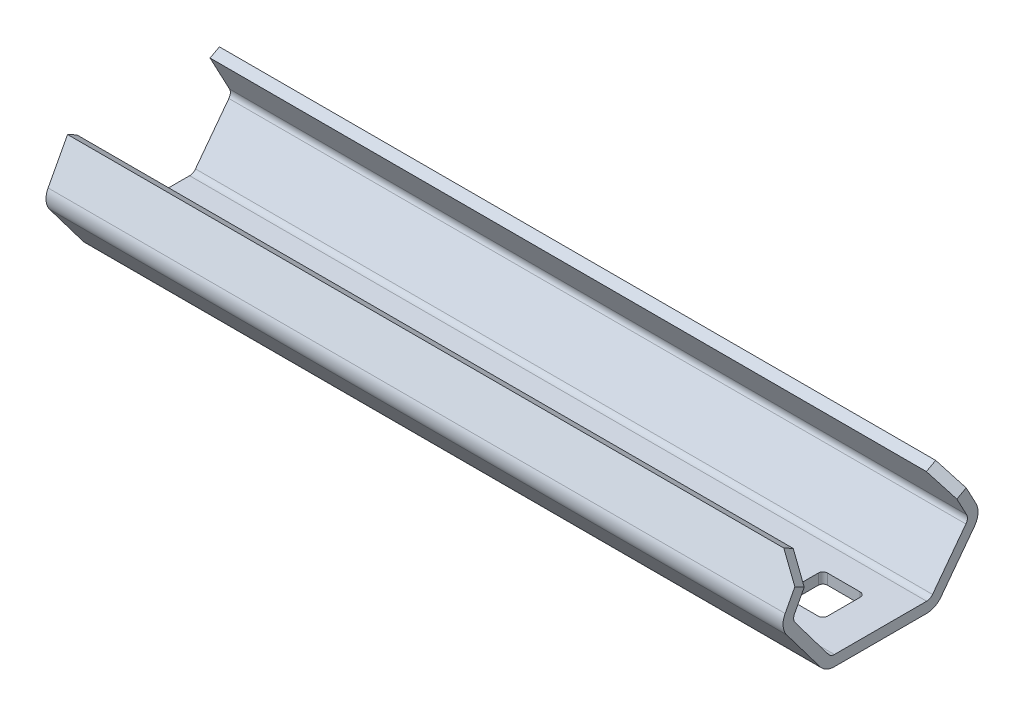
ISO-10303-21;
HEADER;
FILE_DESCRIPTION(('STEP AP214'),'2;1');
FILE_NAME('part.step','',(''),(''),'','','');
FILE_SCHEMA(('AUTOMOTIVE_DESIGN { 1 0 10303 214 1 1 1 1 }'));
ENDSEC;
DATA;
#1=APPLICATION_CONTEXT('core data for automotive mechanical design processes');
#2=APPLICATION_PROTOCOL_DEFINITION('international standard','automotive_design',2000,#1);
#3=PRODUCT_CONTEXT('',#1,'mechanical');
#4=PRODUCT('Part','Part','',(#3));
#5=PRODUCT_RELATED_PRODUCT_CATEGORY('part','',(#4));
#6=PRODUCT_DEFINITION_FORMATION('','',#4);
#7=PRODUCT_DEFINITION_CONTEXT('part definition',#1,'design');
#8=PRODUCT_DEFINITION('design','',#6,#7);
#9=PRODUCT_DEFINITION_SHAPE('','',#8);
#10=(LENGTH_UNIT() NAMED_UNIT(*) SI_UNIT(.MILLI.,.METRE.));
#11=(NAMED_UNIT(*) PLANE_ANGLE_UNIT() SI_UNIT($,.RADIAN.));
#12=(NAMED_UNIT(*) SI_UNIT($,.STERADIAN.) SOLID_ANGLE_UNIT());
#13=UNCERTAINTY_MEASURE_WITH_UNIT(LENGTH_MEASURE(1.E-05),#10,'distance_accuracy_value','');
#14=(GEOMETRIC_REPRESENTATION_CONTEXT(3) GLOBAL_UNCERTAINTY_ASSIGNED_CONTEXT((#13)) GLOBAL_UNIT_ASSIGNED_CONTEXT((#10,
#11,#12)) REPRESENTATION_CONTEXT('',''));
#15=CARTESIAN_POINT('',(0.,0.,0.));
#16=DIRECTION('',(0.,0.,1.));
#17=DIRECTION('',(1.,0.,0.));
#18=AXIS2_PLACEMENT_3D('',#15,#16,#17);
#19=CARTESIAN_POINT('',(228.77824845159,7.33597029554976,31.639996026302));
#20=DIRECTION('',(0.,-0.469471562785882,-0.882947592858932));
#21=DIRECTION('',(0.,0.882947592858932,-0.469471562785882));
#22=AXIS2_PLACEMENT_3D('',#19,#20,#21);
#23=PLANE('',#22);
#24=DIRECTION('',(1.,0.,0.));
#25=VECTOR('',#24,1.);
#26=CARTESIAN_POINT('',(-76.0217515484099,11.8213440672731,29.2550804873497));
#27=LINE('',#26,#25);
#28=CARTESIAN_POINT('',(226.49224845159,11.8213440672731,29.2550804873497));
#29=VERTEX_POINT('',#28);
#30=CARTESIAN_POINT('',(147.574,11.8213440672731,29.2550804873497));
#31=VERTEX_POINT('',#30);
#32=EDGE_CURVE('E573',#29,#31,#27,.F.);
#33=ORIENTED_EDGE('',*,*,#32,.T.);
#34=DIRECTION('',(0.,-0.882947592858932,0.469471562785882));
#35=VECTOR('',#34,1.);
#36=CARTESIAN_POINT('',(147.574,7.33597029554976,31.639996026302));
#37=LINE('',#36,#35);
#38=CARTESIAN_POINT('',(147.574,7.79317001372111,31.3968986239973));
#39=VERTEX_POINT('',#38);
#40=EDGE_CURVE('E1075',#31,#39,#37,.T.);
#41=ORIENTED_EDGE('',*,*,#40,.T.);
#42=DIRECTION('',(1.,0.,0.));
#43=VECTOR('',#42,1.);
#44=CARTESIAN_POINT('',(-228.433271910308,7.79317002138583,31.3968986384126));
#45=LINE('',#44,#43);
#46=CARTESIAN_POINT('',(228.77824845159,7.79317001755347,31.3968986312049));
#47=VERTEX_POINT('',#46);
#48=EDGE_CURVE('E568',#47,#39,#45,.F.);
#49=ORIENTED_EDGE('',*,*,#48,.F.);
#50=DIRECTION('',(0.,0.882947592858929,-0.469471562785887));
#51=VECTOR('',#50,1.);
#52=CARTESIAN_POINT('',(228.77824845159,7.79317001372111,31.3968986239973));
#53=LINE('',#52,#51);
#54=CARTESIAN_POINT('',(228.77824845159,9.80292586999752,30.3282924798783));
#55=VERTEX_POINT('',#54);
#56=EDGE_CURVE('E590',#47,#55,#53,.T.);
#57=ORIENTED_EDGE('',*,*,#56,.T.);
#58=DIRECTION('',(-0.707106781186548,0.624338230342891,-0.331966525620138));
#59=VECTOR('',#58,1.);
#60=CARTESIAN_POINT('',(228.77824845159,9.80292586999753,30.3282924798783));
#61=LINE('',#60,#59);
#62=EDGE_CURVE('E592',#55,#29,#61,.T.);
#63=ORIENTED_EDGE('',*,*,#62,.T.);
#64=EDGE_LOOP('',(#33,#41,#49,#57,#63));
#65=FACE_BOUND('',#64,.T.);
#66=ADVANCED_FACE('F34',(#65),#23,.F.);
#67=CARTESIAN_POINT('',(-76.0217515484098,7.33597029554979,10.1377295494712));
#68=DIRECTION('',(0.,0.469471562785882,-0.882947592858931));
#69=DIRECTION('',(0.,0.882947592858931,0.469471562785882));
#70=AXIS2_PLACEMENT_3D('',#67,#68,#69);
#71=PLANE('',#70);
#72=DIRECTION('',(0.,-0.882947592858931,-0.469471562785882));
#73=VECTOR('',#72,1.);
#74=CARTESIAN_POINT('',(147.574,7.33597029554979,10.1377295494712));
#75=LINE('',#74,#73);
#76=CARTESIAN_POINT('',(147.574,11.8213440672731,12.5226450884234));
#77=VERTEX_POINT('',#76);
#78=CARTESIAN_POINT('',(147.574,7.79317001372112,10.3808269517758));
#79=VERTEX_POINT('',#78);
#80=EDGE_CURVE('E1028',#77,#79,#75,.T.);
#81=ORIENTED_EDGE('',*,*,#80,.F.);
#82=DIRECTION('',(1.,0.,0.));
#83=VECTOR('',#82,1.);
#84=CARTESIAN_POINT('',(228.77824845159,11.8213440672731,12.5226450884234));
#85=LINE('',#84,#83);
#86=CARTESIAN_POINT('',(226.49224845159,11.8213440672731,12.5226450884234));
#87=VERTEX_POINT('',#86);
#88=EDGE_CURVE('E37',#77,#87,#85,.T.);
#89=ORIENTED_EDGE('',*,*,#88,.T.);
#90=DIRECTION('',(0.707106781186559,-0.624338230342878,-0.331966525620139));
#91=VECTOR('',#90,1.);
#92=CARTESIAN_POINT('',(226.49224845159,11.8213440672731,12.5226450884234));
#93=LINE('',#92,#91);
#94=CARTESIAN_POINT('',(228.77824845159,9.80292586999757,11.4494330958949));
#95=VERTEX_POINT('',#94);
#96=EDGE_CURVE('E1003',#87,#95,#93,.T.);
#97=ORIENTED_EDGE('',*,*,#96,.T.);
#98=DIRECTION('',(0.,-0.882947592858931,-0.469471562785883));
#99=VECTOR('',#98,1.);
#100=CARTESIAN_POINT('',(228.77824845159,9.80292586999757,11.4494330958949));
#101=LINE('',#100,#99);
#102=CARTESIAN_POINT('',(228.77824845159,7.79317001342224,10.380826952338));
#103=VERTEX_POINT('',#102);
#104=EDGE_CURVE('E992',#95,#103,#101,.T.);
#105=ORIENTED_EDGE('',*,*,#104,.T.);
#106=DIRECTION('',(-1.,0.,0.));
#107=VECTOR('',#106,1.);
#108=CARTESIAN_POINT('',(381.189768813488,7.79317001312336,10.3808269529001));
#109=LINE('',#108,#107);
#110=EDGE_CURVE('E565',#79,#103,#109,.F.);
#111=ORIENTED_EDGE('',*,*,#110,.F.);
#112=EDGE_LOOP('',(#81,#89,#97,#105,#111));
#113=FACE_BOUND('',#112,.T.);
#114=ADVANCED_FACE('F1026',(#113),#71,.T.);
#115=CARTESIAN_POINT('',(-76.0217515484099,11.8213440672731,29.2550804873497));
#116=DIRECTION('',(0.,-0.882947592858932,0.469471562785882));
#117=DIRECTION('',(0.,-0.469471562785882,-0.882947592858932));
#118=AXIS2_PLACEMENT_3D('',#115,#116,#117);
#119=PLANE('',#118);
#120=DIRECTION('',(1.,0.,0.));
#121=VECTOR('',#120,1.);
#122=CARTESIAN_POINT('',(228.77824845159,11.2728134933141,28.2234445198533));
#123=LINE('',#122,#121);
#124=CARTESIAN_POINT('',(147.574,11.2728134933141,28.2234445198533));
#125=VERTEX_POINT('',#124);
#126=CARTESIAN_POINT('',(226.49224845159,11.2728134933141,28.2234445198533));
#127=VERTEX_POINT('',#126);
#128=EDGE_CURVE('E564',#125,#127,#123,.T.);
#129=ORIENTED_EDGE('',*,*,#128,.F.);
#130=DIRECTION('',(0.,0.469471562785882,0.882947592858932));
#131=VECTOR('',#130,1.);
#132=CARTESIAN_POINT('',(147.574,11.8213440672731,29.2550804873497));
#133=LINE('',#132,#131);
#134=EDGE_CURVE('E1072',#125,#31,#133,.T.);
#135=ORIENTED_EDGE('',*,*,#134,.T.);
#136=ORIENTED_EDGE('',*,*,#32,.F.);
#137=DIRECTION('',(0.,-0.469471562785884,-0.882947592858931));
#138=VECTOR('',#137,1.);
#139=CARTESIAN_POINT('',(226.49224845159,11.8213440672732,29.2550804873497));
#140=LINE('',#139,#138);
#141=EDGE_CURVE('E597',#29,#127,#140,.T.);
#142=ORIENTED_EDGE('',*,*,#141,.T.);
#143=EDGE_LOOP('',(#129,#135,#136,#142));
#144=FACE_BOUND('',#143,.T.);
#145=ADVANCED_FACE('F1590',(#144),#119,.F.);
#146=CARTESIAN_POINT('',(226.49224845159,11.8213440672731,29.2550804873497));
#147=DIRECTION('',(-0.707106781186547,-0.62433823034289,0.331966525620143));
#148=DIRECTION('',(0.661872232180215,-0.749616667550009,0.));
#149=AXIS2_PLACEMENT_3D('',#146,#147,#148);
#150=PLANE('',#149);
#151=DIRECTION('',(0.,-0.469471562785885,-0.88294759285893));
#152=VECTOR('',#151,1.);
#153=CARTESIAN_POINT('',(228.77824845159,9.80292586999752,30.3282924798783));
#154=LINE('',#153,#152);
#155=CARTESIAN_POINT('',(228.77824845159,9.2543952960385,29.2966565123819));
#156=VERTEX_POINT('',#155);
#157=EDGE_CURVE('E569',#55,#156,#154,.T.);
#158=ORIENTED_EDGE('',*,*,#157,.T.);
#159=DIRECTION('',(0.707106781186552,-0.624338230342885,0.331966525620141));
#160=VECTOR('',#159,1.);
#161=CARTESIAN_POINT('',(226.49224845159,11.2728134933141,28.2234445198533));
#162=LINE('',#161,#160);
#163=EDGE_CURVE('E605',#127,#156,#162,.T.);
#164=ORIENTED_EDGE('',*,*,#163,.F.);
#165=ORIENTED_EDGE('',*,*,#141,.F.);
#166=ORIENTED_EDGE('',*,*,#62,.F.);
#167=EDGE_LOOP('',(#158,#164,#165,#166));
#168=FACE_BOUND('',#167,.T.);
#169=ADVANCED_FACE('F1599',(#168),#150,.F.);
#170=CARTESIAN_POINT('',(-228.433271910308,6.86305295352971,29.6476028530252));
#171=DIRECTION('',(1.,0.,0.));
#172=DIRECTION('',(0.,0.,-1.));
#173=AXIS2_PLACEMENT_3D('',#170,#171,#172);
#174=CYLINDRICAL_SURFACE('',#173,1.98120001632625);
#175=CARTESIAN_POINT('',(147.574,6.86305295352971,29.6476028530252));
#176=DIRECTION('',(1.,0.,0.));
#177=DIRECTION('',(0.,0.,-1.));
#178=AXIS2_PLACEMENT_3D('',#175,#176,#177);
#179=CIRCLE('',#178,1.98120001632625);
#180=CARTESIAN_POINT('',(147.574,5.67073701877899,31.2298595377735));
#181=VERTEX_POINT('',#180);
#182=EDGE_CURVE('E1078',#181,#39,#179,.F.);
#183=ORIENTED_EDGE('',*,*,#182,.F.);
#184=DIRECTION('',(1.,0.,0.));
#185=VECTOR('',#184,1.);
#186=CARTESIAN_POINT('',(-76.0217515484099,5.67073702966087,31.2298595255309));
#187=LINE('',#186,#185);
#188=CARTESIAN_POINT('',(228.77824845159,5.67073702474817,31.2298595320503));
#189=VERTEX_POINT('',#188);
#190=EDGE_CURVE('E557',#181,#189,#187,.T.);
#191=ORIENTED_EDGE('',*,*,#190,.T.);
#192=CARTESIAN_POINT('',(228.77824845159,6.86305295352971,29.6476028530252));
#193=DIRECTION('',(1.,0.,0.));
#194=DIRECTION('',(0.,0.,-1.));
#195=AXIS2_PLACEMENT_3D('',#192,#193,#194);
#196=CIRCLE('',#195,1.98120001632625);
#197=EDGE_CURVE('E566',#189,#47,#196,.F.);
#198=ORIENTED_EDGE('',*,*,#197,.T.);
#199=ORIENTED_EDGE('',*,*,#48,.T.);
#200=EDGE_LOOP('',(#183,#191,#198,#199));
#201=FACE_BOUND('',#200,.T.);
#202=ADVANCED_FACE('F1593',(#201),#174,.T.);
#203=CARTESIAN_POINT('',(228.77824845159,11.8213440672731,12.5226450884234));
#204=DIRECTION('',(0.,-0.882947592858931,-0.469471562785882));
#205=DIRECTION('',(0.,0.469471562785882,-0.882947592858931));
#206=AXIS2_PLACEMENT_3D('',#203,#204,#205);
#207=PLANE('',#206);
#208=ORIENTED_EDGE('',*,*,#88,.F.);
#209=DIRECTION('',(0.,-0.469471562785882,0.882947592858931));
#210=VECTOR('',#209,1.);
#211=CARTESIAN_POINT('',(147.574,11.8213440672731,12.5226450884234));
#212=LINE('',#211,#210);
#213=CARTESIAN_POINT('',(147.574,11.2728134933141,13.5542810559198));
#214=VERTEX_POINT('',#213);
#215=EDGE_CURVE('E1031',#77,#214,#212,.T.);
#216=ORIENTED_EDGE('',*,*,#215,.T.);
#217=DIRECTION('',(1.,0.,0.));
#218=VECTOR('',#217,1.);
#219=CARTESIAN_POINT('',(-76.0217515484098,11.2728134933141,13.5542810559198));
#220=LINE('',#219,#218);
#221=CARTESIAN_POINT('',(226.49224845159,11.2728134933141,13.5542810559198));
#222=VERTEX_POINT('',#221);
#223=EDGE_CURVE('E556',#214,#222,#220,.T.);
#224=ORIENTED_EDGE('',*,*,#223,.T.);
#225=DIRECTION('',(0.,0.469471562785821,-0.882947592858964));
#226=VECTOR('',#225,1.);
#227=CARTESIAN_POINT('',(226.49224845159,11.2728134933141,13.5542810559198));
#228=LINE('',#227,#226);
#229=EDGE_CURVE('E1007',#222,#87,#228,.T.);
#230=ORIENTED_EDGE('',*,*,#229,.T.);
#231=EDGE_LOOP('',(#208,#216,#224,#230));
#232=FACE_BOUND('',#231,.T.);
#233=ADVANCED_FACE('F1030',(#232),#207,.F.);
#234=CARTESIAN_POINT('',(228.77824845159,9.80292586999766,11.4494330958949));
#235=DIRECTION('',(-0.707106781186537,-0.624338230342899,-0.331966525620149));
#236=DIRECTION('',(0.661872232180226,-0.749616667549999,0.));
#237=AXIS2_PLACEMENT_3D('',#234,#235,#236);
#238=PLANE('',#237);
#239=ORIENTED_EDGE('',*,*,#229,.F.);
#240=DIRECTION('',(0.707106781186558,-0.62433823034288,-0.331966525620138));
#241=VECTOR('',#240,1.);
#242=CARTESIAN_POINT('',(226.49224845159,11.2728134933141,13.5542810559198));
#243=LINE('',#242,#241);
#244=CARTESIAN_POINT('',(228.77824845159,9.25439529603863,12.4810690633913));
#245=VERTEX_POINT('',#244);
#246=EDGE_CURVE('E578',#222,#245,#243,.T.);
#247=ORIENTED_EDGE('',*,*,#246,.T.);
#248=DIRECTION('',(0.,0.469471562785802,-0.882947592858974));
#249=VECTOR('',#248,1.);
#250=CARTESIAN_POINT('',(228.77824845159,9.25439529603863,12.4810690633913));
#251=LINE('',#250,#249);
#252=EDGE_CURVE('E998',#245,#95,#251,.T.);
#253=ORIENTED_EDGE('',*,*,#252,.T.);
#254=ORIENTED_EDGE('',*,*,#96,.F.);
#255=EDGE_LOOP('',(#239,#247,#253,#254));
#256=FACE_BOUND('',#255,.T.);
#257=ADVANCED_FACE('F1043',(#256),#238,.F.);
#258=CARTESIAN_POINT('',(381.189768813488,6.86305295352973,12.1301227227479));
#259=DIRECTION('',(-1.,0.,0.));
#260=DIRECTION('',(0.,0.,1.));
#261=AXIS2_PLACEMENT_3D('',#258,#259,#260);
#262=CYLINDRICAL_SURFACE('',#261,1.9811999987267);
#263=CARTESIAN_POINT('',(147.574,6.86305295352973,12.1301227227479));
#264=DIRECTION('',(1.,0.,0.));
#265=DIRECTION('',(0.,0.,-1.));
#266=AXIS2_PLACEMENT_3D('',#263,#264,#265);
#267=CIRCLE('',#266,1.9811999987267);
#268=CARTESIAN_POINT('',(147.574,5.67073703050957,10.5478660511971));
#269=VERTEX_POINT('',#268);
#270=EDGE_CURVE('E1054',#79,#269,#267,.F.);
#271=ORIENTED_EDGE('',*,*,#270,.F.);
#272=ORIENTED_EDGE('',*,*,#110,.T.);
#273=CARTESIAN_POINT('',(228.77824845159,6.86305295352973,12.1301227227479));
#274=DIRECTION('',(-1.,0.,0.));
#275=DIRECTION('',(0.,0.,1.));
#276=AXIS2_PLACEMENT_3D('',#273,#274,#275);
#277=CIRCLE('',#276,1.9811999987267);
#278=CARTESIAN_POINT('',(228.77824845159,5.67073703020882,10.5478660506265));
#279=VERTEX_POINT('',#278);
#280=EDGE_CURVE('E562',#103,#279,#277,.T.);
#281=ORIENTED_EDGE('',*,*,#280,.T.);
#282=DIRECTION('',(1.,0.,0.));
#283=VECTOR('',#282,1.);
#284=CARTESIAN_POINT('',(-76.0217515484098,5.67073702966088,10.5478660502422));
#285=LINE('',#284,#283);
#286=EDGE_CURVE('E589',#279,#269,#285,.F.);
#287=ORIENTED_EDGE('',*,*,#286,.T.);
#288=EDGE_LOOP('',(#271,#272,#281,#287));
#289=FACE_BOUND('',#288,.T.);
#290=ADVANCED_FACE('F1052',(#289),#262,.T.);
#291=CARTESIAN_POINT('',(228.77824845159,6.78743972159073,30.6083600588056));
#292=DIRECTION('',(0.,-0.469471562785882,-0.882947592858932));
#293=DIRECTION('',(0.,0.882947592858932,-0.469471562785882));
#294=AXIS2_PLACEMENT_3D('',#291,#292,#293);
#295=PLANE('',#294);
#296=DIRECTION('',(0.,-0.882947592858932,0.469471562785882));
#297=VECTOR('',#296,1.);
#298=CARTESIAN_POINT('',(147.574,6.78743972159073,30.6083600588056));
#299=LINE('',#298,#297);
#300=CARTESIAN_POINT('',(147.574,7.24463944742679,30.3652626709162));
#301=VERTEX_POINT('',#300);
#302=EDGE_CURVE('E1070',#125,#301,#299,.T.);
#303=ORIENTED_EDGE('',*,*,#302,.F.);
#304=ORIENTED_EDGE('',*,*,#128,.T.);
#305=ORIENTED_EDGE('',*,*,#163,.T.);
#306=DIRECTION('',(0.,0.882947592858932,-0.469471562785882));
#307=VECTOR('',#306,1.);
#308=CARTESIAN_POINT('',(228.77824845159,6.78743972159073,30.6083600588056));
#309=LINE('',#308,#307);
#310=CARTESIAN_POINT('',(228.77824845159,7.24463944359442,30.3652626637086));
#311=VERTEX_POINT('',#310);
#312=EDGE_CURVE('E561',#156,#311,#309,.F.);
#313=ORIENTED_EDGE('',*,*,#312,.T.);
#314=DIRECTION('',(1.,0.,0.));
#315=VECTOR('',#314,1.);
#316=CARTESIAN_POINT('',(-228.433271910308,7.24463944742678,30.3652626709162));
#317=LINE('',#316,#315);
#318=EDGE_CURVE('E586',#311,#301,#317,.F.);
#319=ORIENTED_EDGE('',*,*,#318,.T.);
#320=EDGE_LOOP('',(#303,#304,#305,#313,#319));
#321=FACE_BOUND('',#320,.T.);
#322=ADVANCED_FACE('F1623',(#321),#295,.T.);
#323=CARTESIAN_POINT('',(-76.0217515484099,6.08427904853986,31.5414857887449));
#324=DIRECTION('',(0.,0.601815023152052,-0.79863551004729));
#325=DIRECTION('',(0.,0.79863551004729,0.601815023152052));
#326=AXIS2_PLACEMENT_3D('',#323,#324,#325);
#327=PLANE('',#326);
#328=ORIENTED_EDGE('',*,*,#190,.F.);
#329=DIRECTION('',(0.,-0.79863551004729,-0.601815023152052));
#330=VECTOR('',#329,1.);
#331=CARTESIAN_POINT('',(147.574,6.08427904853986,31.5414857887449));
#332=LINE('',#331,#330);
#333=CARTESIAN_POINT('',(147.574,0.788884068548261,27.5511194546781));
#334=VERTEX_POINT('',#333);
#335=EDGE_CURVE('E527',#181,#334,#332,.T.);
#336=ORIENTED_EDGE('',*,*,#335,.T.);
#337=DIRECTION('',(1.,0.,0.));
#338=VECTOR('',#337,1.);
#339=CARTESIAN_POINT('',(-228.426468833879,0.788884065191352,27.5511194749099));
#340=LINE('',#339,#338);
#341=CARTESIAN_POINT('',(228.77824845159,0.788884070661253,27.5511194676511));
#342=VERTEX_POINT('',#341);
#343=EDGE_CURVE('E525',#342,#334,#340,.F.);
#344=ORIENTED_EDGE('',*,*,#343,.F.);
#345=DIRECTION('',(0.,0.79863551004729,0.601815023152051));
#346=VECTOR('',#345,1.);
#347=CARTESIAN_POINT('',(228.77824845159,0.788884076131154,27.5511194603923));
#348=LINE('',#347,#346);
#349=EDGE_CURVE('E552',#342,#189,#348,.T.);
#350=ORIENTED_EDGE('',*,*,#349,.T.);
#351=EDGE_LOOP('',(#328,#336,#344,#350));
#352=FACE_BOUND('',#351,.T.);
#353=ADVANCED_FACE('F1631',(#352),#327,.F.);
#354=CARTESIAN_POINT('',(-76.0217515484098,6.78743972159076,11.1693655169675));
#355=DIRECTION('',(0.,0.469471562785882,-0.882947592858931));
#356=DIRECTION('',(0.,0.882947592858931,0.469471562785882));
#357=AXIS2_PLACEMENT_3D('',#354,#355,#356);
#358=PLANE('',#357);
#359=ORIENTED_EDGE('',*,*,#223,.F.);
#360=DIRECTION('',(0.,-0.882947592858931,-0.469471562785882));
#361=VECTOR('',#360,1.);
#362=CARTESIAN_POINT('',(147.574,6.78743972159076,11.1693655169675));
#363=LINE('',#362,#361);
#364=CARTESIAN_POINT('',(147.574,7.24463943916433,11.4124629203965));
#365=VERTEX_POINT('',#364);
#366=EDGE_CURVE('E1033',#214,#365,#363,.T.);
#367=ORIENTED_EDGE('',*,*,#366,.T.);
#368=DIRECTION('',(-1.,0.,0.));
#369=VECTOR('',#368,1.);
#370=CARTESIAN_POINT('',(381.189768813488,7.24463943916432,11.4124629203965));
#371=LINE('',#370,#369);
#372=CARTESIAN_POINT('',(228.77824845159,7.24463943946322,11.4124629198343));
#373=VERTEX_POINT('',#372);
#374=EDGE_CURVE('E624',#365,#373,#371,.F.);
#375=ORIENTED_EDGE('',*,*,#374,.T.);
#376=DIRECTION('',(0.,0.882947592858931,0.469471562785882));
#377=VECTOR('',#376,1.);
#378=CARTESIAN_POINT('',(228.77824845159,6.78743972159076,11.1693655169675));
#379=LINE('',#378,#377);
#380=EDGE_CURVE('E995',#245,#373,#379,.F.);
#381=ORIENTED_EDGE('',*,*,#380,.F.);
#382=ORIENTED_EDGE('',*,*,#246,.F.);
#383=EDGE_LOOP('',(#359,#367,#375,#381,#382));
#384=FACE_BOUND('',#383,.T.);
#385=ADVANCED_FACE('F1038',(#384),#358,.F.);
#386=CARTESIAN_POINT('',(-76.0217515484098,0.465239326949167,14.4704899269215));
#387=DIRECTION('',(0.,0.601815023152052,0.79863551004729));
#388=DIRECTION('',(0.,-0.79863551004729,0.601815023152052));
#389=AXIS2_PLACEMENT_3D('',#386,#387,#388);
#390=PLANE('',#389);
#391=DIRECTION('',(-1.,0.,0.));
#392=VECTOR('',#391,1.);
#393=CARTESIAN_POINT('',(381.182965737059,0.788884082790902,14.2266061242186));
#394=LINE('',#393,#392);
#395=CARTESIAN_POINT('',(147.574,0.788884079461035,14.2266061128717));
#396=VERTEX_POINT('',#395);
#397=CARTESIAN_POINT('',(228.77824845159,0.788884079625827,14.2266061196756));
#398=VERTEX_POINT('',#397);
#399=EDGE_CURVE('E549',#396,#398,#394,.F.);
#400=ORIENTED_EDGE('',*,*,#399,.F.);
#401=DIRECTION('',(0.,0.79863551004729,-0.601815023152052));
#402=VECTOR('',#401,1.);
#403=CARTESIAN_POINT('',(147.574,0.465239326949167,14.4704899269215));
#404=LINE('',#403,#402);
#405=EDGE_CURVE('E1056',#396,#269,#404,.T.);
#406=ORIENTED_EDGE('',*,*,#405,.T.);
#407=ORIENTED_EDGE('',*,*,#286,.F.);
#408=DIRECTION('',(0.,-0.79863551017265,0.601815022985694));
#409=VECTOR('',#408,1.);
#410=CARTESIAN_POINT('',(228.77824845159,5.67073703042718,10.5478660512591));
#411=LINE('',#410,#409);
#412=EDGE_CURVE('E548',#279,#398,#411,.T.);
#413=ORIENTED_EDGE('',*,*,#412,.T.);
#414=EDGE_LOOP('',(#400,#406,#407,#413));
#415=FACE_BOUND('',#414,.T.);
#416=ADVANCED_FACE('F1648',(#415),#390,.F.);
#417=CARTESIAN_POINT('',(-228.433271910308,6.86305295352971,29.6476028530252));
#418=DIRECTION('',(1.,0.,0.));
#419=DIRECTION('',(0.,0.,-1.));
#420=AXIS2_PLACEMENT_3D('',#417,#418,#419);
#421=CYLINDRICAL_SURFACE('',#420,0.812800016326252);
#422=DIRECTION('',(1.,0.,0.));
#423=VECTOR('',#422,1.);
#424=CARTESIAN_POINT('',(-76.0217515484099,6.37389770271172,30.2967337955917));
#425=LINE('',#424,#423);
#426=CARTESIAN_POINT('',(147.574,6.37389769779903,30.2967337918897));
#427=VERTEX_POINT('',#426);
#428=CARTESIAN_POINT('',(228.778248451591,6.37389769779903,30.296733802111));
#429=VERTEX_POINT('',#428);
#430=EDGE_CURVE('E542',#427,#429,#425,.T.);
#431=ORIENTED_EDGE('',*,*,#430,.F.);
#432=CARTESIAN_POINT('',(147.574,6.86305295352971,29.6476028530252));
#433=DIRECTION('',(1.,0.,0.));
#434=DIRECTION('',(0.,0.,-1.));
#435=AXIS2_PLACEMENT_3D('',#432,#433,#434);
#436=CIRCLE('',#435,0.812800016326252);
#437=EDGE_CURVE('E1067',#427,#301,#436,.F.);
#438=ORIENTED_EDGE('',*,*,#437,.T.);
#439=ORIENTED_EDGE('',*,*,#318,.F.);
#440=CARTESIAN_POINT('',(228.77824845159,6.86305295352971,29.6476028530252));
#441=DIRECTION('',(1.,0.,0.));
#442=DIRECTION('',(0.,0.,-1.));
#443=AXIS2_PLACEMENT_3D('',#440,#441,#442);
#444=CIRCLE('',#443,0.812800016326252);
#445=EDGE_CURVE('E526',#311,#429,#444,.T.);
#446=ORIENTED_EDGE('',*,*,#445,.T.);
#447=EDGE_LOOP('',(#431,#438,#439,#446));
#448=FACE_BOUND('',#447,.T.);
#449=ADVANCED_FACE('F1656',(#448),#421,.F.);
#450=CARTESIAN_POINT('',(-228.426468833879,1.9812,25.9688627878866));
#451=DIRECTION('',(1.,0.,0.));
#452=DIRECTION('',(0.,0.,-1.));
#453=AXIS2_PLACEMENT_3D('',#450,#451,#452);
#454=CYLINDRICAL_SURFACE('',#453,1.98120001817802);
#455=CARTESIAN_POINT('',(147.574,1.9812,25.9688627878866));
#456=DIRECTION('',(1.,0.,0.));
#457=DIRECTION('',(0.,0.,-1.));
#458=AXIS2_PLACEMENT_3D('',#455,#456,#457);
#459=CIRCLE('',#458,1.98120001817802);
#460=CARTESIAN_POINT('',(147.574,0.,25.9688627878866));
#461=VERTEX_POINT('',#460);
#462=EDGE_CURVE('E509',#461,#334,#459,.F.);
#463=ORIENTED_EDGE('',*,*,#462,.F.);
#464=DIRECTION('',(1.,0.,0.));
#465=VECTOR('',#464,1.);
#466=CARTESIAN_POINT('',(-228.426468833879,-1.81780241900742E-08,25.9688627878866));
#467=LINE('',#466,#465);
#468=CARTESIAN_POINT('',(228.77824845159,-9.0890120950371E-09,25.9688627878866));
#469=VERTEX_POINT('',#468);
#470=EDGE_CURVE('E522',#461,#469,#467,.T.);
#471=ORIENTED_EDGE('',*,*,#470,.T.);
#472=CARTESIAN_POINT('',(228.77824845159,1.9812,25.9688627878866));
#473=DIRECTION('',(1.,0.,0.));
#474=DIRECTION('',(0.,0.,-1.));
#475=AXIS2_PLACEMENT_3D('',#472,#473,#474);
#476=CIRCLE('',#475,1.98120001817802);
#477=EDGE_CURVE('E550',#469,#342,#476,.F.);
#478=ORIENTED_EDGE('',*,*,#477,.T.);
#479=ORIENTED_EDGE('',*,*,#343,.T.);
#480=EDGE_LOOP('',(#463,#471,#478,#479));
#481=FACE_BOUND('',#480,.T.);
#482=ADVANCED_FACE('F521',(#481),#454,.T.);
#483=CARTESIAN_POINT('',(381.182965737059,1.9812,15.8088627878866));
#484=DIRECTION('',(-1.,0.,0.));
#485=DIRECTION('',(0.,0.,1.));
#486=AXIS2_PLACEMENT_3D('',#483,#484,#485);
#487=CYLINDRICAL_SURFACE('',#486,1.98119998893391);
#488=CARTESIAN_POINT('',(147.574,1.9812,15.8088627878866));
#489=DIRECTION('',(1.,0.,0.));
#490=DIRECTION('',(0.,0.,-1.));
#491=AXIS2_PLACEMENT_3D('',#488,#489,#490);
#492=CIRCLE('',#491,1.98119998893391);
#493=CARTESIAN_POINT('',(147.574,0.,15.8088627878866));
#494=VERTEX_POINT('',#493);
#495=EDGE_CURVE('E1058',#396,#494,#492,.F.);
#496=ORIENTED_EDGE('',*,*,#495,.F.);
#497=ORIENTED_EDGE('',*,*,#399,.T.);
#498=CARTESIAN_POINT('',(228.77824845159,1.9812,15.8088627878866));
#499=DIRECTION('',(-1.,0.,0.));
#500=DIRECTION('',(0.,0.,1.));
#501=AXIS2_PLACEMENT_3D('',#498,#499,#500);
#502=CIRCLE('',#501,1.98119998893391);
#503=CARTESIAN_POINT('',(228.77824845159,5.53304667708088E-09,15.8088627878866));
#504=VERTEX_POINT('',#503);
#505=EDGE_CURVE('E546',#398,#504,#502,.T.);
#506=ORIENTED_EDGE('',*,*,#505,.T.);
#507=DIRECTION('',(-1.,0.,0.));
#508=VECTOR('',#507,1.);
#509=CARTESIAN_POINT('',(381.182965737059,1.10660933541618E-08,15.8088627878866));
#510=LINE('',#509,#508);
#511=EDGE_CURVE('E535',#504,#494,#510,.T.);
#512=ORIENTED_EDGE('',*,*,#511,.T.);
#513=EDGE_LOOP('',(#496,#497,#506,#512));
#514=FACE_BOUND('',#513,.T.);
#515=ADVANCED_FACE('F1673',(#514),#487,.T.);
#516=CARTESIAN_POINT('',(381.189768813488,6.86305295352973,12.1301227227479));
#517=DIRECTION('',(-1.,0.,0.));
#518=DIRECTION('',(0.,0.,1.));
#519=AXIS2_PLACEMENT_3D('',#516,#517,#518);
#520=CYLINDRICAL_SURFACE('',#519,0.812799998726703);
#521=ORIENTED_EDGE('',*,*,#374,.F.);
#522=CARTESIAN_POINT('',(147.574,6.86305295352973,12.1301227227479));
#523=DIRECTION('',(1.,0.,0.));
#524=DIRECTION('',(0.,0.,-1.));
#525=AXIS2_PLACEMENT_3D('',#522,#523,#524);
#526=CIRCLE('',#525,0.812799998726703);
#527=CARTESIAN_POINT('',(147.574,6.37389770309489,11.4809917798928));
#528=VERTEX_POINT('',#527);
#529=EDGE_CURVE('E1931',#365,#528,#526,.F.);
#530=ORIENTED_EDGE('',*,*,#529,.T.);
#531=DIRECTION('',(1.,0.,0.));
#532=VECTOR('',#531,1.);
#533=CARTESIAN_POINT('',(-76.0217515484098,6.37389770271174,11.4809917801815));
#534=LINE('',#533,#532);
#535=CARTESIAN_POINT('',(228.77824845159,6.37389770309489,11.4809917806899));
#536=VERTEX_POINT('',#535);
#537=EDGE_CURVE('E619',#536,#528,#534,.F.);
#538=ORIENTED_EDGE('',*,*,#537,.F.);
#539=CARTESIAN_POINT('',(228.77824845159,6.86305295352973,12.1301227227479));
#540=DIRECTION('',(-1.,0.,0.));
#541=DIRECTION('',(0.,0.,1.));
#542=AXIS2_PLACEMENT_3D('',#539,#540,#541);
#543=CIRCLE('',#542,0.812799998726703);
#544=EDGE_CURVE('E570',#536,#373,#543,.F.);
#545=ORIENTED_EDGE('',*,*,#544,.T.);
#546=EDGE_LOOP('',(#521,#530,#538,#545));
#547=FACE_BOUND('',#546,.T.);
#548=ADVANCED_FACE('F1681',(#547),#520,.F.);
#549=CARTESIAN_POINT('',(-76.0217515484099,6.78743972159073,30.6083600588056));
#550=DIRECTION('',(0.,0.601815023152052,-0.79863551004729));
#551=DIRECTION('',(0.,0.79863551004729,0.601815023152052));
#552=AXIS2_PLACEMENT_3D('',#549,#550,#551);
#553=PLANE('',#552);
#554=DIRECTION('',(0.,-0.79863551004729,-0.601815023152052));
#555=VECTOR('',#554,1.);
#556=CARTESIAN_POINT('',(147.574,6.78743972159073,30.6083600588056));
#557=LINE('',#556,#555);
#558=CARTESIAN_POINT('',(147.574,1.49204473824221,26.6179937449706));
#559=VERTEX_POINT('',#558);
#560=EDGE_CURVE('E1065',#427,#559,#557,.T.);
#561=ORIENTED_EDGE('',*,*,#560,.F.);
#562=ORIENTED_EDGE('',*,*,#430,.T.);
#563=DIRECTION('',(0.,0.79863551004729,0.601815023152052));
#564=VECTOR('',#563,1.);
#565=CARTESIAN_POINT('',(228.77824845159,6.78743972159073,30.6083600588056));
#566=LINE('',#565,#564);
#567=CARTESIAN_POINT('',(228.77824845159,1.49204474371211,26.6179937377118));
#568=VERTEX_POINT('',#567);
#569=EDGE_CURVE('E536',#429,#568,#566,.F.);
#570=ORIENTED_EDGE('',*,*,#569,.T.);
#571=DIRECTION('',(1.,0.,0.));
#572=VECTOR('',#571,1.);
#573=CARTESIAN_POINT('',(-228.426468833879,1.49204473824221,26.6179937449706));
#574=LINE('',#573,#572);
#575=EDGE_CURVE('E791',#568,#559,#574,.F.);
#576=ORIENTED_EDGE('',*,*,#575,.T.);
#577=EDGE_LOOP('',(#561,#562,#570,#576));
#578=FACE_BOUND('',#577,.T.);
#579=ADVANCED_FACE('F1690',(#578),#553,.T.);
#580=CARTESIAN_POINT('',(-76.0217515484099,0.,25.9688627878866));
#581=DIRECTION('',(0.,1.,0.));
#582=DIRECTION('',(0.,0.,1.));
#583=AXIS2_PLACEMENT_3D('',#580,#581,#582);
#584=PLANE('',#583);
#585=ORIENTED_EDGE('',*,*,#470,.F.);
#586=DIRECTION('',(0.,0.,-1.));
#587=VECTOR('',#586,1.);
#588=CARTESIAN_POINT('',(147.574,0.,10.1176617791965));
#589=LINE('',#588,#587);
#590=CARTESIAN_POINT('',(147.574,0.,23.2002627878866));
#591=VERTEX_POINT('',#590);
#592=EDGE_CURVE('E506',#461,#591,#589,.T.);
#593=ORIENTED_EDGE('',*,*,#592,.T.);
#594=DIRECTION('',(1.,0.,0.));
#595=VECTOR('',#594,1.);
#596=CARTESIAN_POINT('',(-76.0217515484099,0.,23.2002627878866));
#597=LINE('',#596,#595);
#598=CARTESIAN_POINT('',(148.03164845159,0.,23.2002627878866));
#599=VERTEX_POINT('',#598);
#600=EDGE_CURVE('E792',#591,#599,#597,.T.);
#601=ORIENTED_EDGE('',*,*,#600,.T.);
#602=CARTESIAN_POINT('',(148.03164845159,0.,22.6922627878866));
#603=DIRECTION('',(0.,-1.,0.));
#604=DIRECTION('',(0.,0.,-1.));
#605=AXIS2_PLACEMENT_3D('',#602,#603,#604);
#606=CIRCLE('',#605,0.507999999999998);
#607=CARTESIAN_POINT('',(148.53964845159,0.,22.6922627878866));
#608=VERTEX_POINT('',#607);
#609=EDGE_CURVE('E796',#599,#608,#606,.F.);
#610=ORIENTED_EDGE('',*,*,#609,.T.);
#611=DIRECTION('',(0.,0.,1.));
#612=VECTOR('',#611,1.);
#613=CARTESIAN_POINT('',(148.53964845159,0.,25.9688627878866));
#614=LINE('',#613,#612);
#615=CARTESIAN_POINT('',(148.53964845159,0.,19.0854627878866));
#616=VERTEX_POINT('',#615);
#617=EDGE_CURVE('E799',#608,#616,#614,.F.);
#618=ORIENTED_EDGE('',*,*,#617,.T.);
#619=CARTESIAN_POINT('',(148.03164845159,0.,19.0854627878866));
#620=DIRECTION('',(0.,-1.,0.));
#621=DIRECTION('',(0.,0.,-1.));
#622=AXIS2_PLACEMENT_3D('',#619,#620,#621);
#623=CIRCLE('',#622,0.507999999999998);
#624=CARTESIAN_POINT('',(148.03164845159,0.,18.5774627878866));
#625=VERTEX_POINT('',#624);
#626=EDGE_CURVE('E802',#616,#625,#623,.F.);
#627=ORIENTED_EDGE('',*,*,#626,.T.);
#628=DIRECTION('',(1.,0.,0.));
#629=VECTOR('',#628,1.);
#630=CARTESIAN_POINT('',(-76.0217515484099,0.,18.5774627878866));
#631=LINE('',#630,#629);
#632=CARTESIAN_POINT('',(147.574,0.,18.5774627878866));
#633=VERTEX_POINT('',#632);
#634=EDGE_CURVE('E804',#625,#633,#631,.F.);
#635=ORIENTED_EDGE('',*,*,#634,.T.);
#636=EDGE_CURVE('E517',#633,#494,#589,.T.);
#637=ORIENTED_EDGE('',*,*,#636,.T.);
#638=ORIENTED_EDGE('',*,*,#511,.F.);
#639=DIRECTION('',(0.,0.,1.));
#640=VECTOR('',#639,1.);
#641=CARTESIAN_POINT('',(228.77824845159,0.,25.9688627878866));
#642=LINE('',#641,#640);
#643=EDGE_CURVE('E534',#504,#469,#642,.T.);
#644=ORIENTED_EDGE('',*,*,#643,.T.);
#645=EDGE_LOOP('',(#585,#593,#601,#610,#618,#627,#635,#637,#638,#644));
#646=FACE_BOUND('',#645,.T.);
#647=CARTESIAN_POINT('',(157.12484845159,0.,19.0854627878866));
#648=DIRECTION('',(0.,-1.,0.));
#649=DIRECTION('',(0.,0.,-1.));
#650=AXIS2_PLACEMENT_3D('',#647,#648,#649);
#651=CIRCLE('',#650,0.507999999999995);
#652=CARTESIAN_POINT('',(157.12484845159,0.,18.5774627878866));
#653=VERTEX_POINT('',#652);
#654=CARTESIAN_POINT('',(156.61684845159,0.,19.0854627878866));
#655=VERTEX_POINT('',#654);
#656=EDGE_CURVE('E830',#653,#655,#651,.F.);
#657=ORIENTED_EDGE('',*,*,#656,.T.);
#658=DIRECTION('',(0.,0.,1.));
#659=VECTOR('',#658,1.);
#660=CARTESIAN_POINT('',(156.61684845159,0.,25.9688627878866));
#661=LINE('',#660,#659);
#662=CARTESIAN_POINT('',(156.61684845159,0.,22.6922627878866));
#663=VERTEX_POINT('',#662);
#664=EDGE_CURVE('E808',#655,#663,#661,.T.);
#665=ORIENTED_EDGE('',*,*,#664,.T.);
#666=CARTESIAN_POINT('',(157.12484845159,0.,22.6922627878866));
#667=DIRECTION('',(0.,-1.,0.));
#668=DIRECTION('',(0.,0.,-1.));
#669=AXIS2_PLACEMENT_3D('',#666,#667,#668);
#670=CIRCLE('',#669,0.508000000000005);
#671=CARTESIAN_POINT('',(157.12484845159,0.,23.2002627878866));
#672=VERTEX_POINT('',#671);
#673=EDGE_CURVE('E811',#663,#672,#670,.F.);
#674=ORIENTED_EDGE('',*,*,#673,.T.);
#675=DIRECTION('',(1.,0.,0.));
#676=VECTOR('',#675,1.);
#677=CARTESIAN_POINT('',(-76.0217515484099,0.,23.2002627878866));
#678=LINE('',#677,#676);
#679=CARTESIAN_POINT('',(160.73164845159,0.,23.2002627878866));
#680=VERTEX_POINT('',#679);
#681=EDGE_CURVE('E815',#672,#680,#678,.T.);
#682=ORIENTED_EDGE('',*,*,#681,.T.);
#683=CARTESIAN_POINT('',(160.73164845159,0.,22.6922627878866));
#684=DIRECTION('',(0.,-1.,0.));
#685=DIRECTION('',(0.,0.,-1.));
#686=AXIS2_PLACEMENT_3D('',#683,#684,#685);
#687=CIRCLE('',#686,0.507999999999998);
#688=CARTESIAN_POINT('',(161.23964845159,0.,22.6922627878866));
#689=VERTEX_POINT('',#688);
#690=EDGE_CURVE('E818',#680,#689,#687,.F.);
#691=ORIENTED_EDGE('',*,*,#690,.T.);
#692=DIRECTION('',(0.,0.,1.));
#693=VECTOR('',#692,1.);
#694=CARTESIAN_POINT('',(161.23964845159,0.,25.9688627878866));
#695=LINE('',#694,#693);
#696=CARTESIAN_POINT('',(161.23964845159,0.,19.0854627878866));
#697=VERTEX_POINT('',#696);
#698=EDGE_CURVE('E821',#689,#697,#695,.F.);
#699=ORIENTED_EDGE('',*,*,#698,.T.);
#700=CARTESIAN_POINT('',(160.73164845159,0.,19.0854627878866));
#701=DIRECTION('',(0.,-1.,0.));
#702=DIRECTION('',(0.,0.,-1.));
#703=AXIS2_PLACEMENT_3D('',#700,#701,#702);
#704=CIRCLE('',#703,0.507999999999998);
#705=CARTESIAN_POINT('',(160.73164845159,0.,18.5774627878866));
#706=VERTEX_POINT('',#705);
#707=EDGE_CURVE('E824',#697,#706,#704,.F.);
#708=ORIENTED_EDGE('',*,*,#707,.T.);
#709=DIRECTION('',(1.,0.,0.));
#710=VECTOR('',#709,1.);
#711=CARTESIAN_POINT('',(-76.0217515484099,0.,18.5774627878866));
#712=LINE('',#711,#710);
#713=EDGE_CURVE('E828',#706,#653,#712,.F.);
#714=ORIENTED_EDGE('',*,*,#713,.T.);
#715=EDGE_LOOP('',(#657,#665,#674,#682,#691,#699,#708,#714));
#716=FACE_BOUND('',#715,.T.);
#717=CARTESIAN_POINT('',(169.82484845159,0.,19.0854627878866));
#718=DIRECTION('',(0.,-1.,0.));
#719=DIRECTION('',(0.,0.,-1.));
#720=AXIS2_PLACEMENT_3D('',#717,#718,#719);
#721=CIRCLE('',#720,0.507999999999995);
#722=CARTESIAN_POINT('',(169.82484845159,0.,18.5774627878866));
#723=VERTEX_POINT('',#722);
#724=CARTESIAN_POINT('',(169.31684845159,0.,19.0854627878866));
#725=VERTEX_POINT('',#724);
#726=EDGE_CURVE('E855',#723,#725,#721,.F.);
#727=ORIENTED_EDGE('',*,*,#726,.T.);
#728=DIRECTION('',(0.,0.,1.));
#729=VECTOR('',#728,1.);
#730=CARTESIAN_POINT('',(169.31684845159,0.,25.9688627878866));
#731=LINE('',#730,#729);
#732=CARTESIAN_POINT('',(169.31684845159,0.,22.6922627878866));
#733=VERTEX_POINT('',#732);
#734=EDGE_CURVE('E833',#725,#733,#731,.T.);
#735=ORIENTED_EDGE('',*,*,#734,.T.);
#736=CARTESIAN_POINT('',(169.82484845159,0.,22.6922627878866));
#737=DIRECTION('',(0.,-1.,0.));
#738=DIRECTION('',(0.,0.,-1.));
#739=AXIS2_PLACEMENT_3D('',#736,#737,#738);
#740=CIRCLE('',#739,0.508000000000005);
#741=CARTESIAN_POINT('',(169.82484845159,0.,23.2002627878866));
#742=VERTEX_POINT('',#741);
#743=EDGE_CURVE('E836',#733,#742,#740,.F.);
#744=ORIENTED_EDGE('',*,*,#743,.T.);
#745=DIRECTION('',(1.,0.,0.));
#746=VECTOR('',#745,1.);
#747=CARTESIAN_POINT('',(-76.0217515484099,0.,23.2002627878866));
#748=LINE('',#747,#746);
#749=CARTESIAN_POINT('',(173.43164845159,0.,23.2002627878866));
#750=VERTEX_POINT('',#749);
#751=EDGE_CURVE('E840',#742,#750,#748,.T.);
#752=ORIENTED_EDGE('',*,*,#751,.T.);
#753=CARTESIAN_POINT('',(173.43164845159,0.,22.6922627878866));
#754=DIRECTION('',(0.,-1.,0.));
#755=DIRECTION('',(0.,0.,-1.));
#756=AXIS2_PLACEMENT_3D('',#753,#754,#755);
#757=CIRCLE('',#756,0.507999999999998);
#758=CARTESIAN_POINT('',(173.93964845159,0.,22.6922627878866));
#759=VERTEX_POINT('',#758);
#760=EDGE_CURVE('E843',#750,#759,#757,.F.);
#761=ORIENTED_EDGE('',*,*,#760,.T.);
#762=DIRECTION('',(0.,0.,1.));
#763=VECTOR('',#762,1.);
#764=CARTESIAN_POINT('',(173.93964845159,0.,25.9688627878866));
#765=LINE('',#764,#763);
#766=CARTESIAN_POINT('',(173.93964845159,0.,19.0854627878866));
#767=VERTEX_POINT('',#766);
#768=EDGE_CURVE('E846',#759,#767,#765,.F.);
#769=ORIENTED_EDGE('',*,*,#768,.T.);
#770=CARTESIAN_POINT('',(173.43164845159,0.,19.0854627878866));
#771=DIRECTION('',(0.,-1.,0.));
#772=DIRECTION('',(0.,0.,-1.));
#773=AXIS2_PLACEMENT_3D('',#770,#771,#772);
#774=CIRCLE('',#773,0.507999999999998);
#775=CARTESIAN_POINT('',(173.43164845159,0.,18.5774627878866));
#776=VERTEX_POINT('',#775);
#777=EDGE_CURVE('E849',#767,#776,#774,.F.);
#778=ORIENTED_EDGE('',*,*,#777,.T.);
#779=DIRECTION('',(1.,0.,0.));
#780=VECTOR('',#779,1.);
#781=CARTESIAN_POINT('',(-76.0217515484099,0.,18.5774627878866));
#782=LINE('',#781,#780);
#783=EDGE_CURVE('E853',#776,#723,#782,.F.);
#784=ORIENTED_EDGE('',*,*,#783,.T.);
#785=EDGE_LOOP('',(#727,#735,#744,#752,#761,#769,#778,#784));
#786=FACE_BOUND('',#785,.T.);
#787=CARTESIAN_POINT('',(182.52484845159,0.,19.0854627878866));
#788=DIRECTION('',(0.,-1.,0.));
#789=DIRECTION('',(0.,0.,-1.));
#790=AXIS2_PLACEMENT_3D('',#787,#788,#789);
#791=CIRCLE('',#790,0.507999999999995);
#792=CARTESIAN_POINT('',(182.52484845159,0.,18.5774627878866));
#793=VERTEX_POINT('',#792);
#794=CARTESIAN_POINT('',(182.01684845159,0.,19.0854627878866));
#795=VERTEX_POINT('',#794);
#796=EDGE_CURVE('E880',#793,#795,#791,.F.);
#797=ORIENTED_EDGE('',*,*,#796,.T.);
#798=DIRECTION('',(0.,0.,1.));
#799=VECTOR('',#798,1.);
#800=CARTESIAN_POINT('',(182.01684845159,0.,25.9688627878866));
#801=LINE('',#800,#799);
#802=CARTESIAN_POINT('',(182.01684845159,0.,22.6922627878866));
#803=VERTEX_POINT('',#802);
#804=EDGE_CURVE('E858',#795,#803,#801,.T.);
#805=ORIENTED_EDGE('',*,*,#804,.T.);
#806=CARTESIAN_POINT('',(182.52484845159,0.,22.6922627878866));
#807=DIRECTION('',(0.,-1.,0.));
#808=DIRECTION('',(0.,0.,-1.));
#809=AXIS2_PLACEMENT_3D('',#806,#807,#808);
#810=CIRCLE('',#809,0.508000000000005);
#811=CARTESIAN_POINT('',(182.52484845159,0.,23.2002627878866));
#812=VERTEX_POINT('',#811);
#813=EDGE_CURVE('E861',#803,#812,#810,.F.);
#814=ORIENTED_EDGE('',*,*,#813,.T.);
#815=DIRECTION('',(1.,0.,0.));
#816=VECTOR('',#815,1.);
#817=CARTESIAN_POINT('',(-76.0217515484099,0.,23.2002627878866));
#818=LINE('',#817,#816);
#819=CARTESIAN_POINT('',(186.13164845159,0.,23.2002627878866));
#820=VERTEX_POINT('',#819);
#821=EDGE_CURVE('E865',#812,#820,#818,.T.);
#822=ORIENTED_EDGE('',*,*,#821,.T.);
#823=CARTESIAN_POINT('',(186.13164845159,0.,22.6922627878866));
#824=DIRECTION('',(0.,-1.,0.));
#825=DIRECTION('',(0.,0.,-1.));
#826=AXIS2_PLACEMENT_3D('',#823,#824,#825);
#827=CIRCLE('',#826,0.507999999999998);
#828=CARTESIAN_POINT('',(186.63964845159,0.,22.6922627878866));
#829=VERTEX_POINT('',#828);
#830=EDGE_CURVE('E868',#820,#829,#827,.F.);
#831=ORIENTED_EDGE('',*,*,#830,.T.);
#832=DIRECTION('',(0.,0.,1.));
#833=VECTOR('',#832,1.);
#834=CARTESIAN_POINT('',(186.63964845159,0.,25.9688627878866));
#835=LINE('',#834,#833);
#836=CARTESIAN_POINT('',(186.63964845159,0.,19.0854627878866));
#837=VERTEX_POINT('',#836);
#838=EDGE_CURVE('E871',#829,#837,#835,.F.);
#839=ORIENTED_EDGE('',*,*,#838,.T.);
#840=CARTESIAN_POINT('',(186.13164845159,0.,19.0854627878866));
#841=DIRECTION('',(0.,-1.,0.));
#842=DIRECTION('',(0.,0.,-1.));
#843=AXIS2_PLACEMENT_3D('',#840,#841,#842);
#844=CIRCLE('',#843,0.507999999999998);
#845=CARTESIAN_POINT('',(186.13164845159,0.,18.5774627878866));
#846=VERTEX_POINT('',#845);
#847=EDGE_CURVE('E874',#837,#846,#844,.F.);
#848=ORIENTED_EDGE('',*,*,#847,.T.);
#849=DIRECTION('',(1.,0.,0.));
#850=VECTOR('',#849,1.);
#851=CARTESIAN_POINT('',(-76.0217515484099,0.,18.5774627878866));
#852=LINE('',#851,#850);
#853=EDGE_CURVE('E878',#846,#793,#852,.F.);
#854=ORIENTED_EDGE('',*,*,#853,.T.);
#855=EDGE_LOOP('',(#797,#805,#814,#822,#831,#839,#848,#854));
#856=FACE_BOUND('',#855,.T.);
#857=CARTESIAN_POINT('',(195.22484845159,0.,19.0854627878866));
#858=DIRECTION('',(0.,-1.,0.));
#859=DIRECTION('',(0.,0.,-1.));
#860=AXIS2_PLACEMENT_3D('',#857,#858,#859);
#861=CIRCLE('',#860,0.507999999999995);
#862=CARTESIAN_POINT('',(195.22484845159,0.,18.5774627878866));
#863=VERTEX_POINT('',#862);
#864=CARTESIAN_POINT('',(194.71684845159,0.,19.0854627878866));
#865=VERTEX_POINT('',#864);
#866=EDGE_CURVE('E905',#863,#865,#861,.F.);
#867=ORIENTED_EDGE('',*,*,#866,.T.);
#868=DIRECTION('',(0.,0.,1.));
#869=VECTOR('',#868,1.);
#870=CARTESIAN_POINT('',(194.71684845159,0.,25.9688627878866));
#871=LINE('',#870,#869);
#872=CARTESIAN_POINT('',(194.71684845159,0.,22.6922627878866));
#873=VERTEX_POINT('',#872);
#874=EDGE_CURVE('E883',#865,#873,#871,.T.);
#875=ORIENTED_EDGE('',*,*,#874,.T.);
#876=CARTESIAN_POINT('',(195.22484845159,0.,22.6922627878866));
#877=DIRECTION('',(0.,-1.,0.));
#878=DIRECTION('',(0.,0.,-1.));
#879=AXIS2_PLACEMENT_3D('',#876,#877,#878);
#880=CIRCLE('',#879,0.508000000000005);
#881=CARTESIAN_POINT('',(195.22484845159,0.,23.2002627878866));
#882=VERTEX_POINT('',#881);
#883=EDGE_CURVE('E886',#873,#882,#880,.F.);
#884=ORIENTED_EDGE('',*,*,#883,.T.);
#885=DIRECTION('',(1.,0.,0.));
#886=VECTOR('',#885,1.);
#887=CARTESIAN_POINT('',(-76.0217515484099,0.,23.2002627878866));
#888=LINE('',#887,#886);
#889=CARTESIAN_POINT('',(198.83164845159,0.,23.2002627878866));
#890=VERTEX_POINT('',#889);
#891=EDGE_CURVE('E890',#882,#890,#888,.T.);
#892=ORIENTED_EDGE('',*,*,#891,.T.);
#893=CARTESIAN_POINT('',(198.83164845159,0.,22.6922627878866));
#894=DIRECTION('',(0.,-1.,0.));
#895=DIRECTION('',(0.,0.,-1.));
#896=AXIS2_PLACEMENT_3D('',#893,#894,#895);
#897=CIRCLE('',#896,0.507999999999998);
#898=CARTESIAN_POINT('',(199.33964845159,0.,22.6922627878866));
#899=VERTEX_POINT('',#898);
#900=EDGE_CURVE('E893',#890,#899,#897,.F.);
#901=ORIENTED_EDGE('',*,*,#900,.T.);
#902=DIRECTION('',(0.,0.,1.));
#903=VECTOR('',#902,1.);
#904=CARTESIAN_POINT('',(199.33964845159,0.,25.9688627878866));
#905=LINE('',#904,#903);
#906=CARTESIAN_POINT('',(199.33964845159,0.,19.0854627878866));
#907=VERTEX_POINT('',#906);
#908=EDGE_CURVE('E896',#899,#907,#905,.F.);
#909=ORIENTED_EDGE('',*,*,#908,.T.);
#910=CARTESIAN_POINT('',(198.83164845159,0.,19.0854627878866));
#911=DIRECTION('',(0.,-1.,0.));
#912=DIRECTION('',(0.,0.,-1.));
#913=AXIS2_PLACEMENT_3D('',#910,#911,#912);
#914=CIRCLE('',#913,0.507999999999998);
#915=CARTESIAN_POINT('',(198.83164845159,0.,18.5774627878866));
#916=VERTEX_POINT('',#915);
#917=EDGE_CURVE('E899',#907,#916,#914,.F.);
#918=ORIENTED_EDGE('',*,*,#917,.T.);
#919=DIRECTION('',(1.,0.,0.));
#920=VECTOR('',#919,1.);
#921=CARTESIAN_POINT('',(-76.0217515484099,0.,18.5774627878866));
#922=LINE('',#921,#920);
#923=EDGE_CURVE('E903',#916,#863,#922,.F.);
#924=ORIENTED_EDGE('',*,*,#923,.T.);
#925=EDGE_LOOP('',(#867,#875,#884,#892,#901,#909,#918,#924));
#926=FACE_BOUND('',#925,.T.);
#927=CARTESIAN_POINT('',(207.92484845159,0.,19.0854627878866));
#928=DIRECTION('',(0.,-1.,0.));
#929=DIRECTION('',(0.,0.,-1.));
#930=AXIS2_PLACEMENT_3D('',#927,#928,#929);
#931=CIRCLE('',#930,0.507999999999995);
#932=CARTESIAN_POINT('',(207.92484845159,0.,18.5774627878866));
#933=VERTEX_POINT('',#932);
#934=CARTESIAN_POINT('',(207.41684845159,0.,19.0854627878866));
#935=VERTEX_POINT('',#934);
#936=EDGE_CURVE('E930',#933,#935,#931,.F.);
#937=ORIENTED_EDGE('',*,*,#936,.T.);
#938=DIRECTION('',(0.,0.,1.));
#939=VECTOR('',#938,1.);
#940=CARTESIAN_POINT('',(207.41684845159,0.,25.9688627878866));
#941=LINE('',#940,#939);
#942=CARTESIAN_POINT('',(207.41684845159,0.,22.6922627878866));
#943=VERTEX_POINT('',#942);
#944=EDGE_CURVE('E908',#935,#943,#941,.T.);
#945=ORIENTED_EDGE('',*,*,#944,.T.);
#946=CARTESIAN_POINT('',(207.92484845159,0.,22.6922627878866));
#947=DIRECTION('',(0.,-1.,0.));
#948=DIRECTION('',(0.,0.,-1.));
#949=AXIS2_PLACEMENT_3D('',#946,#947,#948);
#950=CIRCLE('',#949,0.508000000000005);
#951=CARTESIAN_POINT('',(207.92484845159,0.,23.2002627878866));
#952=VERTEX_POINT('',#951);
#953=EDGE_CURVE('E911',#943,#952,#950,.F.);
#954=ORIENTED_EDGE('',*,*,#953,.T.);
#955=DIRECTION('',(1.,0.,0.));
#956=VECTOR('',#955,1.);
#957=CARTESIAN_POINT('',(-76.0217515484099,0.,23.2002627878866));
#958=LINE('',#957,#956);
#959=CARTESIAN_POINT('',(211.53164845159,0.,23.2002627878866));
#960=VERTEX_POINT('',#959);
#961=EDGE_CURVE('E915',#952,#960,#958,.T.);
#962=ORIENTED_EDGE('',*,*,#961,.T.);
#963=CARTESIAN_POINT('',(211.53164845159,0.,22.6922627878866));
#964=DIRECTION('',(0.,-1.,0.));
#965=DIRECTION('',(0.,0.,-1.));
#966=AXIS2_PLACEMENT_3D('',#963,#964,#965);
#967=CIRCLE('',#966,0.507999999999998);
#968=CARTESIAN_POINT('',(212.03964845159,0.,22.6922627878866));
#969=VERTEX_POINT('',#968);
#970=EDGE_CURVE('E918',#960,#969,#967,.F.);
#971=ORIENTED_EDGE('',*,*,#970,.T.);
#972=DIRECTION('',(0.,0.,1.));
#973=VECTOR('',#972,1.);
#974=CARTESIAN_POINT('',(212.03964845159,0.,25.9688627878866));
#975=LINE('',#974,#973);
#976=CARTESIAN_POINT('',(212.03964845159,0.,19.0854627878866));
#977=VERTEX_POINT('',#976);
#978=EDGE_CURVE('E921',#969,#977,#975,.F.);
#979=ORIENTED_EDGE('',*,*,#978,.T.);
#980=CARTESIAN_POINT('',(211.53164845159,0.,19.0854627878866));
#981=DIRECTION('',(0.,-1.,0.));
#982=DIRECTION('',(0.,0.,-1.));
#983=AXIS2_PLACEMENT_3D('',#980,#981,#982);
#984=CIRCLE('',#983,0.507999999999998);
#985=CARTESIAN_POINT('',(211.53164845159,0.,18.5774627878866));
#986=VERTEX_POINT('',#985);
#987=EDGE_CURVE('E924',#977,#986,#984,.F.);
#988=ORIENTED_EDGE('',*,*,#987,.T.);
#989=DIRECTION('',(1.,0.,0.));
#990=VECTOR('',#989,1.);
#991=CARTESIAN_POINT('',(-76.0217515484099,0.,18.5774627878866));
#992=LINE('',#991,#990);
#993=EDGE_CURVE('E928',#986,#933,#992,.F.);
#994=ORIENTED_EDGE('',*,*,#993,.T.);
#995=EDGE_LOOP('',(#937,#945,#954,#962,#971,#979,#988,#994));
#996=FACE_BOUND('',#995,.T.);
#997=CARTESIAN_POINT('',(220.62484845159,0.,19.0854627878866));
#998=DIRECTION('',(0.,-1.,0.));
#999=DIRECTION('',(0.,0.,-1.));
#1000=AXIS2_PLACEMENT_3D('',#997,#998,#999);
#1001=CIRCLE('',#1000,0.507999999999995);
#1002=CARTESIAN_POINT('',(220.62484845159,0.,18.5774627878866));
#1003=VERTEX_POINT('',#1002);
#1004=CARTESIAN_POINT('',(220.11684845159,0.,19.0854627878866));
#1005=VERTEX_POINT('',#1004);
#1006=EDGE_CURVE('E622',#1003,#1005,#1001,.F.);
#1007=ORIENTED_EDGE('',*,*,#1006,.T.);
#1008=DIRECTION('',(0.,0.,1.));
#1009=VECTOR('',#1008,1.);
#1010=CARTESIAN_POINT('',(220.11684845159,0.,25.9688627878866));
#1011=LINE('',#1010,#1009);
#1012=CARTESIAN_POINT('',(220.11684845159,0.,22.6922627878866));
#1013=VERTEX_POINT('',#1012);
#1014=EDGE_CURVE('E933',#1005,#1013,#1011,.T.);
#1015=ORIENTED_EDGE('',*,*,#1014,.T.);
#1016=CARTESIAN_POINT('',(220.62484845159,0.,22.6922627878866));
#1017=DIRECTION('',(0.,-1.,0.));
#1018=DIRECTION('',(0.,0.,-1.));
#1019=AXIS2_PLACEMENT_3D('',#1016,#1017,#1018);
#1020=CIRCLE('',#1019,0.508000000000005);
#1021=CARTESIAN_POINT('',(220.62484845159,0.,23.2002627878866));
#1022=VERTEX_POINT('',#1021);
#1023=EDGE_CURVE('E936',#1013,#1022,#1020,.F.);
#1024=ORIENTED_EDGE('',*,*,#1023,.T.);
#1025=DIRECTION('',(1.,0.,0.));
#1026=VECTOR('',#1025,1.);
#1027=CARTESIAN_POINT('',(-76.0217515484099,0.,23.2002627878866));
#1028=LINE('',#1027,#1026);
#1029=CARTESIAN_POINT('',(224.23164845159,0.,23.2002627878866));
#1030=VERTEX_POINT('',#1029);
#1031=EDGE_CURVE('E940',#1022,#1030,#1028,.T.);
#1032=ORIENTED_EDGE('',*,*,#1031,.T.);
#1033=CARTESIAN_POINT('',(224.23164845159,0.,22.6922627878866));
#1034=DIRECTION('',(0.,-1.,0.));
#1035=DIRECTION('',(0.,0.,-1.));
#1036=AXIS2_PLACEMENT_3D('',#1033,#1034,#1035);
#1037=CIRCLE('',#1036,0.507999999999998);
#1038=CARTESIAN_POINT('',(224.73964845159,0.,22.6922627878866));
#1039=VERTEX_POINT('',#1038);
#1040=EDGE_CURVE('E943',#1030,#1039,#1037,.F.);
#1041=ORIENTED_EDGE('',*,*,#1040,.T.);
#1042=DIRECTION('',(0.,0.,1.));
#1043=VECTOR('',#1042,1.);
#1044=CARTESIAN_POINT('',(224.73964845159,0.,25.9688627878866));
#1045=LINE('',#1044,#1043);
#1046=CARTESIAN_POINT('',(224.73964845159,0.,19.0854627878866));
#1047=VERTEX_POINT('',#1046);
#1048=EDGE_CURVE('E946',#1039,#1047,#1045,.F.);
#1049=ORIENTED_EDGE('',*,*,#1048,.T.);
#1050=CARTESIAN_POINT('',(224.23164845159,0.,19.0854627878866));
#1051=DIRECTION('',(0.,-1.,0.));
#1052=DIRECTION('',(0.,0.,-1.));
#1053=AXIS2_PLACEMENT_3D('',#1050,#1051,#1052);
#1054=CIRCLE('',#1053,0.507999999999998);
#1055=CARTESIAN_POINT('',(224.23164845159,0.,18.5774627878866));
#1056=VERTEX_POINT('',#1055);
#1057=EDGE_CURVE('E949',#1047,#1056,#1054,.F.);
#1058=ORIENTED_EDGE('',*,*,#1057,.T.);
#1059=DIRECTION('',(1.,0.,0.));
#1060=VECTOR('',#1059,1.);
#1061=CARTESIAN_POINT('',(-76.0217515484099,0.,18.5774627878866));
#1062=LINE('',#1061,#1060);
#1063=EDGE_CURVE('E953',#1056,#1003,#1062,.F.);
#1064=ORIENTED_EDGE('',*,*,#1063,.T.);
#1065=EDGE_LOOP('',(#1007,#1015,#1024,#1032,#1041,#1049,#1058,#1064));
#1066=FACE_BOUND('',#1065,.T.);
#1067=ADVANCED_FACE('F530',(#646,#716,#786,#856,#926,#996,#1066),#584,.F.);
#1068=CARTESIAN_POINT('',(-76.0217515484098,1.16840000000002,15.4036156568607));
#1069=DIRECTION('',(0.,0.601815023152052,0.79863551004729));
#1070=DIRECTION('',(0.,-0.79863551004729,0.601815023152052));
#1071=AXIS2_PLACEMENT_3D('',#1068,#1069,#1070);
#1072=PLANE('',#1071);
#1073=DIRECTION('',(0.,0.79863551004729,-0.601815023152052));
#1074=VECTOR('',#1073,1.);
#1075=CARTESIAN_POINT('',(147.574,1.16840000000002,15.4036156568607));
#1076=LINE('',#1075,#1074);
#1077=CARTESIAN_POINT('',(147.574,1.49204475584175,15.1597318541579));
#1078=VERTEX_POINT('',#1077);
#1079=EDGE_CURVE('E1927',#1078,#528,#1076,.T.);
#1080=ORIENTED_EDGE('',*,*,#1079,.F.);
#1081=DIRECTION('',(-1.,0.,0.));
#1082=VECTOR('',#1081,1.);
#1083=CARTESIAN_POINT('',(381.182965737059,1.49204475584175,15.1597318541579));
#1084=LINE('',#1083,#1082);
#1085=CARTESIAN_POINT('',(228.77824845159,1.49204475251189,15.159731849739));
#1086=VERTEX_POINT('',#1085);
#1087=EDGE_CURVE('E789',#1078,#1086,#1084,.F.);
#1088=ORIENTED_EDGE('',*,*,#1087,.T.);
#1089=DIRECTION('',(0.,-0.79863551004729,0.601815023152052));
#1090=VECTOR('',#1089,1.);
#1091=CARTESIAN_POINT('',(228.77824845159,1.16840000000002,15.4036156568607));
#1092=LINE('',#1091,#1090);
#1093=EDGE_CURVE('E539',#1086,#536,#1092,.F.);
#1094=ORIENTED_EDGE('',*,*,#1093,.T.);
#1095=ORIENTED_EDGE('',*,*,#537,.T.);
#1096=EDGE_LOOP('',(#1080,#1088,#1094,#1095));
#1097=FACE_BOUND('',#1096,.T.);
#1098=ADVANCED_FACE('F1707',(#1097),#1072,.T.);
#1099=CARTESIAN_POINT('',(220.62484845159,11.8213440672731,19.0854627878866));
#1100=DIRECTION('',(0.,-1.,0.));
#1101=DIRECTION('',(0.,0.,-1.));
#1102=AXIS2_PLACEMENT_3D('',#1099,#1100,#1101);
#1103=CYLINDRICAL_SURFACE('',#1102,0.507999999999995);
#1104=DIRECTION('',(0.,1.,0.));
#1105=VECTOR('',#1104,1.);
#1106=CARTESIAN_POINT('',(220.11684845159,11.8213440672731,19.0854627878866));
#1107=LINE('',#1106,#1105);
#1108=CARTESIAN_POINT('',(220.11684845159,1.1684,19.0854627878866));
#1109=VERTEX_POINT('',#1108);
#1110=EDGE_CURVE('E935',#1109,#1005,#1107,.F.);
#1111=ORIENTED_EDGE('',*,*,#1110,.T.);
#1112=ORIENTED_EDGE('',*,*,#1006,.F.);
#1113=DIRECTION('',(0.,1.,0.));
#1114=VECTOR('',#1113,1.);
#1115=CARTESIAN_POINT('',(220.62484845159,11.8213440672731,18.5774627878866));
#1116=LINE('',#1115,#1114);
#1117=CARTESIAN_POINT('',(220.62484845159,1.1684,18.5774627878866));
#1118=VERTEX_POINT('',#1117);
#1119=EDGE_CURVE('E951',#1003,#1118,#1116,.T.);
#1120=ORIENTED_EDGE('',*,*,#1119,.T.);
#1121=CARTESIAN_POINT('',(220.62484845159,1.1684,19.0854627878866));
#1122=DIRECTION('',(0.,-1.,0.));
#1123=DIRECTION('',(0.,0.,-1.));
#1124=AXIS2_PLACEMENT_3D('',#1121,#1122,#1123);
#1125=CIRCLE('',#1124,0.507999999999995);
#1126=EDGE_CURVE('E786',#1109,#1118,#1125,.T.);
#1127=ORIENTED_EDGE('',*,*,#1126,.F.);
#1128=EDGE_LOOP('',(#1111,#1112,#1120,#1127));
#1129=FACE_BOUND('',#1128,.T.);
#1130=ADVANCED_FACE('F963',(#1129),#1103,.F.);
#1131=CARTESIAN_POINT('',(220.62484845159,11.8213440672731,18.5774627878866));
#1132=DIRECTION('',(0.,0.,-1.));
#1133=DIRECTION('',(-1.,0.,0.));
#1134=AXIS2_PLACEMENT_3D('',#1131,#1132,#1133);
#1135=PLANE('',#1134);
#1136=ORIENTED_EDGE('',*,*,#1119,.F.);
#1137=ORIENTED_EDGE('',*,*,#1063,.F.);
#1138=DIRECTION('',(0.,-1.,0.));
#1139=VECTOR('',#1138,1.);
#1140=CARTESIAN_POINT('',(224.23164845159,11.8213440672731,18.5774627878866));
#1141=LINE('',#1140,#1139);
#1142=CARTESIAN_POINT('',(224.23164845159,1.1684,18.5774627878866));
#1143=VERTEX_POINT('',#1142);
#1144=EDGE_CURVE('E948',#1056,#1143,#1141,.F.);
#1145=ORIENTED_EDGE('',*,*,#1144,.T.);
#1146=DIRECTION('',(1.,0.,0.));
#1147=VECTOR('',#1146,1.);
#1148=CARTESIAN_POINT('',(-76.0217515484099,1.1684,18.5774627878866));
#1149=LINE('',#1148,#1147);
#1150=EDGE_CURVE('E783',#1118,#1143,#1149,.T.);
#1151=ORIENTED_EDGE('',*,*,#1150,.F.);
#1152=EDGE_LOOP('',(#1136,#1137,#1145,#1151));
#1153=FACE_BOUND('',#1152,.T.);
#1154=ADVANCED_FACE('F1721',(#1153),#1135,.F.);
#1155=CARTESIAN_POINT('',(224.23164845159,11.8213440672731,19.0854627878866));
#1156=DIRECTION('',(0.,-1.,0.));
#1157=DIRECTION('',(0.,0.,-1.));
#1158=AXIS2_PLACEMENT_3D('',#1155,#1156,#1157);
#1159=CYLINDRICAL_SURFACE('',#1158,0.507999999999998);
#1160=ORIENTED_EDGE('',*,*,#1144,.F.);
#1161=ORIENTED_EDGE('',*,*,#1057,.F.);
#1162=DIRECTION('',(0.,1.,0.));
#1163=VECTOR('',#1162,1.);
#1164=CARTESIAN_POINT('',(224.73964845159,11.8213440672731,19.0854627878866));
#1165=LINE('',#1164,#1163);
#1166=CARTESIAN_POINT('',(224.73964845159,1.1684,19.0854627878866));
#1167=VERTEX_POINT('',#1166);
#1168=EDGE_CURVE('E945',#1047,#1167,#1165,.T.);
#1169=ORIENTED_EDGE('',*,*,#1168,.T.);
#1170=CARTESIAN_POINT('',(224.23164845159,1.1684,19.0854627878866));
#1171=DIRECTION('',(0.,-1.,0.));
#1172=DIRECTION('',(0.,0.,-1.));
#1173=AXIS2_PLACEMENT_3D('',#1170,#1171,#1172);
#1174=CIRCLE('',#1173,0.507999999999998);
#1175=EDGE_CURVE('E780',#1143,#1167,#1174,.T.);
#1176=ORIENTED_EDGE('',*,*,#1175,.F.);
#1177=EDGE_LOOP('',(#1160,#1161,#1169,#1176));
#1178=FACE_BOUND('',#1177,.T.);
#1179=ADVANCED_FACE('F1730',(#1178),#1159,.F.);
#1180=CARTESIAN_POINT('',(224.73964845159,11.8213440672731,19.0854627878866));
#1181=DIRECTION('',(1.,0.,0.));
#1182=DIRECTION('',(0.,0.,-1.));
#1183=AXIS2_PLACEMENT_3D('',#1180,#1181,#1182);
#1184=PLANE('',#1183);
#1185=ORIENTED_EDGE('',*,*,#1168,.F.);
#1186=ORIENTED_EDGE('',*,*,#1048,.F.);
#1187=DIRECTION('',(0.,-1.,0.));
#1188=VECTOR('',#1187,1.);
#1189=CARTESIAN_POINT('',(224.73964845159,11.8213440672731,22.6922627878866));
#1190=LINE('',#1189,#1188);
#1191=CARTESIAN_POINT('',(224.73964845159,1.1684,22.6922627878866));
#1192=VERTEX_POINT('',#1191);
#1193=EDGE_CURVE('E942',#1039,#1192,#1190,.F.);
#1194=ORIENTED_EDGE('',*,*,#1193,.T.);
#1195=DIRECTION('',(0.,0.,1.));
#1196=VECTOR('',#1195,1.);
#1197=CARTESIAN_POINT('',(224.73964845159,1.1684,25.9688627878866));
#1198=LINE('',#1197,#1196);
#1199=EDGE_CURVE('E777',#1167,#1192,#1198,.T.);
#1200=ORIENTED_EDGE('',*,*,#1199,.F.);
#1201=EDGE_LOOP('',(#1185,#1186,#1194,#1200));
#1202=FACE_BOUND('',#1201,.T.);
#1203=ADVANCED_FACE('F1740',(#1202),#1184,.F.);
#1204=CARTESIAN_POINT('',(224.23164845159,11.8213440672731,22.6922627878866));
#1205=DIRECTION('',(0.,-1.,0.));
#1206=DIRECTION('',(0.,0.,-1.));
#1207=AXIS2_PLACEMENT_3D('',#1204,#1205,#1206);
#1208=CYLINDRICAL_SURFACE('',#1207,0.507999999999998);
#1209=ORIENTED_EDGE('',*,*,#1193,.F.);
#1210=ORIENTED_EDGE('',*,*,#1040,.F.);
#1211=DIRECTION('',(0.,1.,0.));
#1212=VECTOR('',#1211,1.);
#1213=CARTESIAN_POINT('',(224.23164845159,11.8213440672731,23.2002627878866));
#1214=LINE('',#1213,#1212);
#1215=CARTESIAN_POINT('',(224.23164845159,1.1684,23.2002627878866));
#1216=VERTEX_POINT('',#1215);
#1217=EDGE_CURVE('E939',#1030,#1216,#1214,.T.);
#1218=ORIENTED_EDGE('',*,*,#1217,.T.);
#1219=CARTESIAN_POINT('',(224.23164845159,1.1684,22.6922627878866));
#1220=DIRECTION('',(0.,-1.,0.));
#1221=DIRECTION('',(0.,0.,-1.));
#1222=AXIS2_PLACEMENT_3D('',#1219,#1220,#1221);
#1223=CIRCLE('',#1222,0.507999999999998);
#1224=EDGE_CURVE('E774',#1192,#1216,#1223,.T.);
#1225=ORIENTED_EDGE('',*,*,#1224,.F.);
#1226=EDGE_LOOP('',(#1209,#1210,#1218,#1225));
#1227=FACE_BOUND('',#1226,.T.);
#1228=ADVANCED_FACE('F1750',(#1227),#1208,.F.);
#1229=CARTESIAN_POINT('',(220.62484845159,11.8213440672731,23.2002627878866));
#1230=DIRECTION('',(0.,0.,1.));
#1231=DIRECTION('',(1.,0.,0.));
#1232=AXIS2_PLACEMENT_3D('',#1229,#1230,#1231);
#1233=PLANE('',#1232);
#1234=ORIENTED_EDGE('',*,*,#1217,.F.);
#1235=ORIENTED_EDGE('',*,*,#1031,.F.);
#1236=DIRECTION('',(0.,-1.,0.));
#1237=VECTOR('',#1236,1.);
#1238=CARTESIAN_POINT('',(220.62484845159,11.8213440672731,23.2002627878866));
#1239=LINE('',#1238,#1237);
#1240=CARTESIAN_POINT('',(220.62484845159,1.1684,23.2002627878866));
#1241=VERTEX_POINT('',#1240);
#1242=EDGE_CURVE('E938',#1022,#1241,#1239,.F.);
#1243=ORIENTED_EDGE('',*,*,#1242,.T.);
#1244=DIRECTION('',(1.,0.,0.));
#1245=VECTOR('',#1244,1.);
#1246=CARTESIAN_POINT('',(-76.0217515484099,1.1684,23.2002627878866));
#1247=LINE('',#1246,#1245);
#1248=EDGE_CURVE('E771',#1216,#1241,#1247,.F.);
#1249=ORIENTED_EDGE('',*,*,#1248,.F.);
#1250=EDGE_LOOP('',(#1234,#1235,#1243,#1249));
#1251=FACE_BOUND('',#1250,.T.);
#1252=ADVANCED_FACE('F1760',(#1251),#1233,.F.);
#1253=CARTESIAN_POINT('',(220.62484845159,11.8213440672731,22.6922627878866));
#1254=DIRECTION('',(0.,-1.,0.));
#1255=DIRECTION('',(0.,0.,-1.));
#1256=AXIS2_PLACEMENT_3D('',#1253,#1254,#1255);
#1257=CYLINDRICAL_SURFACE('',#1256,0.508000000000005);
#1258=ORIENTED_EDGE('',*,*,#1242,.F.);
#1259=ORIENTED_EDGE('',*,*,#1023,.F.);
#1260=DIRECTION('',(0.,1.,0.));
#1261=VECTOR('',#1260,1.);
#1262=CARTESIAN_POINT('',(220.11684845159,11.8213440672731,22.6922627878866));
#1263=LINE('',#1262,#1261);
#1264=CARTESIAN_POINT('',(220.11684845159,1.1684,22.6922627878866));
#1265=VERTEX_POINT('',#1264);
#1266=EDGE_CURVE('E932',#1013,#1265,#1263,.T.);
#1267=ORIENTED_EDGE('',*,*,#1266,.T.);
#1268=CARTESIAN_POINT('',(220.62484845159,1.1684,22.6922627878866));
#1269=DIRECTION('',(0.,-1.,0.));
#1270=DIRECTION('',(0.,0.,-1.));
#1271=AXIS2_PLACEMENT_3D('',#1268,#1269,#1270);
#1272=CIRCLE('',#1271,0.508000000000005);
#1273=EDGE_CURVE('E768',#1241,#1265,#1272,.T.);
#1274=ORIENTED_EDGE('',*,*,#1273,.F.);
#1275=EDGE_LOOP('',(#1258,#1259,#1267,#1274));
#1276=FACE_BOUND('',#1275,.T.);
#1277=ADVANCED_FACE('F1770',(#1276),#1257,.F.);
#1278=CARTESIAN_POINT('',(220.11684845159,11.8213440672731,19.0854627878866));
#1279=DIRECTION('',(-1.,0.,0.));
#1280=DIRECTION('',(0.,0.,1.));
#1281=AXIS2_PLACEMENT_3D('',#1278,#1279,#1280);
#1282=PLANE('',#1281);
#1283=ORIENTED_EDGE('',*,*,#1266,.F.);
#1284=ORIENTED_EDGE('',*,*,#1014,.F.);
#1285=ORIENTED_EDGE('',*,*,#1110,.F.);
#1286=DIRECTION('',(0.,0.,1.));
#1287=VECTOR('',#1286,1.);
#1288=CARTESIAN_POINT('',(220.11684845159,1.1684,25.9688627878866));
#1289=LINE('',#1288,#1287);
#1290=EDGE_CURVE('E765',#1265,#1109,#1289,.F.);
#1291=ORIENTED_EDGE('',*,*,#1290,.F.);
#1292=EDGE_LOOP('',(#1283,#1284,#1285,#1291));
#1293=FACE_BOUND('',#1292,.T.);
#1294=ADVANCED_FACE('F968',(#1293),#1282,.F.);
#1295=CARTESIAN_POINT('',(207.92484845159,11.8213440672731,19.0854627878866));
#1296=DIRECTION('',(0.,-1.,0.));
#1297=DIRECTION('',(0.,0.,-1.));
#1298=AXIS2_PLACEMENT_3D('',#1295,#1296,#1297);
#1299=CYLINDRICAL_SURFACE('',#1298,0.507999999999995);
#1300=DIRECTION('',(0.,1.,0.));
#1301=VECTOR('',#1300,1.);
#1302=CARTESIAN_POINT('',(207.41684845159,11.8213440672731,19.0854627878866));
#1303=LINE('',#1302,#1301);
#1304=CARTESIAN_POINT('',(207.41684845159,1.1684,19.0854627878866));
#1305=VERTEX_POINT('',#1304);
#1306=EDGE_CURVE('E910',#1305,#935,#1303,.F.);
#1307=ORIENTED_EDGE('',*,*,#1306,.T.);
#1308=ORIENTED_EDGE('',*,*,#936,.F.);
#1309=DIRECTION('',(0.,1.,0.));
#1310=VECTOR('',#1309,1.);
#1311=CARTESIAN_POINT('',(207.92484845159,11.8213440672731,18.5774627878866));
#1312=LINE('',#1311,#1310);
#1313=CARTESIAN_POINT('',(207.92484845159,1.1684,18.5774627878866));
#1314=VERTEX_POINT('',#1313);
#1315=EDGE_CURVE('E926',#933,#1314,#1312,.T.);
#1316=ORIENTED_EDGE('',*,*,#1315,.T.);
#1317=CARTESIAN_POINT('',(207.92484845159,1.1684,19.0854627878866));
#1318=DIRECTION('',(0.,-1.,0.));
#1319=DIRECTION('',(0.,0.,-1.));
#1320=AXIS2_PLACEMENT_3D('',#1317,#1318,#1319);
#1321=CIRCLE('',#1320,0.507999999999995);
#1322=EDGE_CURVE('E762',#1305,#1314,#1321,.T.);
#1323=ORIENTED_EDGE('',*,*,#1322,.F.);
#1324=EDGE_LOOP('',(#1307,#1308,#1316,#1323));
#1325=FACE_BOUND('',#1324,.T.);
#1326=ADVANCED_FACE('F1146',(#1325),#1299,.F.);
#1327=CARTESIAN_POINT('',(207.92484845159,11.8213440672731,18.5774627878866));
#1328=DIRECTION('',(0.,0.,-1.));
#1329=DIRECTION('',(-1.,0.,0.));
#1330=AXIS2_PLACEMENT_3D('',#1327,#1328,#1329);
#1331=PLANE('',#1330);
#1332=ORIENTED_EDGE('',*,*,#1315,.F.);
#1333=ORIENTED_EDGE('',*,*,#993,.F.);
#1334=DIRECTION('',(0.,-1.,0.));
#1335=VECTOR('',#1334,1.);
#1336=CARTESIAN_POINT('',(211.53164845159,11.8213440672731,18.5774627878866));
#1337=LINE('',#1336,#1335);
#1338=CARTESIAN_POINT('',(211.53164845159,1.1684,18.5774627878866));
#1339=VERTEX_POINT('',#1338);
#1340=EDGE_CURVE('E923',#986,#1339,#1337,.F.);
#1341=ORIENTED_EDGE('',*,*,#1340,.T.);
#1342=DIRECTION('',(1.,0.,0.));
#1343=VECTOR('',#1342,1.);
#1344=CARTESIAN_POINT('',(-76.0217515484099,1.1684,18.5774627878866));
#1345=LINE('',#1344,#1343);
#1346=EDGE_CURVE('E759',#1314,#1339,#1345,.T.);
#1347=ORIENTED_EDGE('',*,*,#1346,.F.);
#1348=EDGE_LOOP('',(#1332,#1333,#1341,#1347));
#1349=FACE_BOUND('',#1348,.T.);
#1350=ADVANCED_FACE('F1141',(#1349),#1331,.F.);
#1351=CARTESIAN_POINT('',(211.53164845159,11.8213440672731,19.0854627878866));
#1352=DIRECTION('',(0.,-1.,0.));
#1353=DIRECTION('',(0.,0.,-1.));
#1354=AXIS2_PLACEMENT_3D('',#1351,#1352,#1353);
#1355=CYLINDRICAL_SURFACE('',#1354,0.507999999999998);
#1356=ORIENTED_EDGE('',*,*,#1340,.F.);
#1357=ORIENTED_EDGE('',*,*,#987,.F.);
#1358=DIRECTION('',(0.,1.,0.));
#1359=VECTOR('',#1358,1.);
#1360=CARTESIAN_POINT('',(212.03964845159,11.8213440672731,19.0854627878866));
#1361=LINE('',#1360,#1359);
#1362=CARTESIAN_POINT('',(212.03964845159,1.1684,19.0854627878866));
#1363=VERTEX_POINT('',#1362);
#1364=EDGE_CURVE('E920',#977,#1363,#1361,.T.);
#1365=ORIENTED_EDGE('',*,*,#1364,.T.);
#1366=CARTESIAN_POINT('',(211.53164845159,1.1684,19.0854627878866));
#1367=DIRECTION('',(0.,-1.,0.));
#1368=DIRECTION('',(0.,0.,-1.));
#1369=AXIS2_PLACEMENT_3D('',#1366,#1367,#1368);
#1370=CIRCLE('',#1369,0.507999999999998);
#1371=EDGE_CURVE('E756',#1339,#1363,#1370,.T.);
#1372=ORIENTED_EDGE('',*,*,#1371,.F.);
#1373=EDGE_LOOP('',(#1356,#1357,#1365,#1372));
#1374=FACE_BOUND('',#1373,.T.);
#1375=ADVANCED_FACE('F1129',(#1374),#1355,.F.);
#1376=CARTESIAN_POINT('',(212.03964845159,11.8213440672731,19.0854627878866));
#1377=DIRECTION('',(1.,0.,0.));
#1378=DIRECTION('',(0.,0.,-1.));
#1379=AXIS2_PLACEMENT_3D('',#1376,#1377,#1378);
#1380=PLANE('',#1379);
#1381=ORIENTED_EDGE('',*,*,#1364,.F.);
#1382=ORIENTED_EDGE('',*,*,#978,.F.);
#1383=DIRECTION('',(0.,-1.,0.));
#1384=VECTOR('',#1383,1.);
#1385=CARTESIAN_POINT('',(212.03964845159,11.8213440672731,22.6922627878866));
#1386=LINE('',#1385,#1384);
#1387=CARTESIAN_POINT('',(212.03964845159,1.1684,22.6922627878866));
#1388=VERTEX_POINT('',#1387);
#1389=EDGE_CURVE('E917',#969,#1388,#1386,.F.);
#1390=ORIENTED_EDGE('',*,*,#1389,.T.);
#1391=DIRECTION('',(0.,0.,1.));
#1392=VECTOR('',#1391,1.);
#1393=CARTESIAN_POINT('',(212.03964845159,1.1684,25.9688627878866));
#1394=LINE('',#1393,#1392);
#1395=EDGE_CURVE('E753',#1363,#1388,#1394,.T.);
#1396=ORIENTED_EDGE('',*,*,#1395,.F.);
#1397=EDGE_LOOP('',(#1381,#1382,#1390,#1396));
#1398=FACE_BOUND('',#1397,.T.);
#1399=ADVANCED_FACE('F1132',(#1398),#1380,.F.);
#1400=CARTESIAN_POINT('',(211.53164845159,11.8213440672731,22.6922627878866));
#1401=DIRECTION('',(0.,-1.,0.));
#1402=DIRECTION('',(0.,0.,-1.));
#1403=AXIS2_PLACEMENT_3D('',#1400,#1401,#1402);
#1404=CYLINDRICAL_SURFACE('',#1403,0.507999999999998);
#1405=ORIENTED_EDGE('',*,*,#1389,.F.);
#1406=ORIENTED_EDGE('',*,*,#970,.F.);
#1407=DIRECTION('',(0.,1.,0.));
#1408=VECTOR('',#1407,1.);
#1409=CARTESIAN_POINT('',(211.53164845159,11.8213440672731,23.2002627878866));
#1410=LINE('',#1409,#1408);
#1411=CARTESIAN_POINT('',(211.53164845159,1.1684,23.2002627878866));
#1412=VERTEX_POINT('',#1411);
#1413=EDGE_CURVE('E914',#960,#1412,#1410,.T.);
#1414=ORIENTED_EDGE('',*,*,#1413,.T.);
#1415=CARTESIAN_POINT('',(211.53164845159,1.1684,22.6922627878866));
#1416=DIRECTION('',(0.,-1.,0.));
#1417=DIRECTION('',(0.,0.,-1.));
#1418=AXIS2_PLACEMENT_3D('',#1415,#1416,#1417);
#1419=CIRCLE('',#1418,0.507999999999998);
#1420=EDGE_CURVE('E750',#1388,#1412,#1419,.T.);
#1421=ORIENTED_EDGE('',*,*,#1420,.F.);
#1422=EDGE_LOOP('',(#1405,#1406,#1414,#1421));
#1423=FACE_BOUND('',#1422,.T.);
#1424=ADVANCED_FACE('F1165',(#1423),#1404,.F.);
#1425=CARTESIAN_POINT('',(207.92484845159,11.8213440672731,23.2002627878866));
#1426=DIRECTION('',(0.,0.,1.));
#1427=DIRECTION('',(1.,0.,0.));
#1428=AXIS2_PLACEMENT_3D('',#1425,#1426,#1427);
#1429=PLANE('',#1428);
#1430=ORIENTED_EDGE('',*,*,#1413,.F.);
#1431=ORIENTED_EDGE('',*,*,#961,.F.);
#1432=DIRECTION('',(0.,-1.,0.));
#1433=VECTOR('',#1432,1.);
#1434=CARTESIAN_POINT('',(207.92484845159,11.8213440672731,23.2002627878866));
#1435=LINE('',#1434,#1433);
#1436=CARTESIAN_POINT('',(207.92484845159,1.1684,23.2002627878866));
#1437=VERTEX_POINT('',#1436);
#1438=EDGE_CURVE('E913',#952,#1437,#1435,.F.);
#1439=ORIENTED_EDGE('',*,*,#1438,.T.);
#1440=DIRECTION('',(1.,0.,0.));
#1441=VECTOR('',#1440,1.);
#1442=CARTESIAN_POINT('',(-76.0217515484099,1.1684,23.2002627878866));
#1443=LINE('',#1442,#1441);
#1444=EDGE_CURVE('E747',#1412,#1437,#1443,.F.);
#1445=ORIENTED_EDGE('',*,*,#1444,.F.);
#1446=EDGE_LOOP('',(#1430,#1431,#1439,#1445));
#1447=FACE_BOUND('',#1446,.T.);
#1448=ADVANCED_FACE('F1162',(#1447),#1429,.F.);
#1449=CARTESIAN_POINT('',(207.92484845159,11.8213440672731,22.6922627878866));
#1450=DIRECTION('',(0.,-1.,0.));
#1451=DIRECTION('',(0.,0.,-1.));
#1452=AXIS2_PLACEMENT_3D('',#1449,#1450,#1451);
#1453=CYLINDRICAL_SURFACE('',#1452,0.508000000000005);
#1454=ORIENTED_EDGE('',*,*,#1438,.F.);
#1455=ORIENTED_EDGE('',*,*,#953,.F.);
#1456=DIRECTION('',(0.,1.,0.));
#1457=VECTOR('',#1456,1.);
#1458=CARTESIAN_POINT('',(207.41684845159,11.8213440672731,22.6922627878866));
#1459=LINE('',#1458,#1457);
#1460=CARTESIAN_POINT('',(207.41684845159,1.1684,22.6922627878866));
#1461=VERTEX_POINT('',#1460);
#1462=EDGE_CURVE('E907',#943,#1461,#1459,.T.);
#1463=ORIENTED_EDGE('',*,*,#1462,.T.);
#1464=CARTESIAN_POINT('',(207.92484845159,1.1684,22.6922627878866));
#1465=DIRECTION('',(0.,-1.,0.));
#1466=DIRECTION('',(0.,0.,-1.));
#1467=AXIS2_PLACEMENT_3D('',#1464,#1465,#1466);
#1468=CIRCLE('',#1467,0.508000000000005);
#1469=EDGE_CURVE('E744',#1437,#1461,#1468,.T.);
#1470=ORIENTED_EDGE('',*,*,#1469,.F.);
#1471=EDGE_LOOP('',(#1454,#1455,#1463,#1470));
#1472=FACE_BOUND('',#1471,.T.);
#1473=ADVANCED_FACE('F1157',(#1472),#1453,.F.);
#1474=CARTESIAN_POINT('',(207.41684845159,11.8213440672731,19.0854627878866));
#1475=DIRECTION('',(-1.,0.,0.));
#1476=DIRECTION('',(0.,0.,1.));
#1477=AXIS2_PLACEMENT_3D('',#1474,#1475,#1476);
#1478=PLANE('',#1477);
#1479=ORIENTED_EDGE('',*,*,#1462,.F.);
#1480=ORIENTED_EDGE('',*,*,#944,.F.);
#1481=ORIENTED_EDGE('',*,*,#1306,.F.);
#1482=DIRECTION('',(0.,0.,1.));
#1483=VECTOR('',#1482,1.);
#1484=CARTESIAN_POINT('',(207.41684845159,1.1684,25.9688627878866));
#1485=LINE('',#1484,#1483);
#1486=EDGE_CURVE('E741',#1461,#1305,#1485,.F.);
#1487=ORIENTED_EDGE('',*,*,#1486,.F.);
#1488=EDGE_LOOP('',(#1479,#1480,#1481,#1487));
#1489=FACE_BOUND('',#1488,.T.);
#1490=ADVANCED_FACE('F1152',(#1489),#1478,.F.);
#1491=CARTESIAN_POINT('',(195.22484845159,11.8213440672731,19.0854627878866));
#1492=DIRECTION('',(0.,-1.,0.));
#1493=DIRECTION('',(0.,0.,-1.));
#1494=AXIS2_PLACEMENT_3D('',#1491,#1492,#1493);
#1495=CYLINDRICAL_SURFACE('',#1494,0.507999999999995);
#1496=DIRECTION('',(0.,1.,0.));
#1497=VECTOR('',#1496,1.);
#1498=CARTESIAN_POINT('',(194.71684845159,11.8213440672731,19.0854627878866));
#1499=LINE('',#1498,#1497);
#1500=CARTESIAN_POINT('',(194.71684845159,1.1684,19.0854627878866));
#1501=VERTEX_POINT('',#1500);
#1502=EDGE_CURVE('E885',#1501,#865,#1499,.F.);
#1503=ORIENTED_EDGE('',*,*,#1502,.T.);
#1504=ORIENTED_EDGE('',*,*,#866,.F.);
#1505=DIRECTION('',(0.,1.,0.));
#1506=VECTOR('',#1505,1.);
#1507=CARTESIAN_POINT('',(195.22484845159,11.8213440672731,18.5774627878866));
#1508=LINE('',#1507,#1506);
#1509=CARTESIAN_POINT('',(195.22484845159,1.1684,18.5774627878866));
#1510=VERTEX_POINT('',#1509);
#1511=EDGE_CURVE('E901',#863,#1510,#1508,.T.);
#1512=ORIENTED_EDGE('',*,*,#1511,.T.);
#1513=CARTESIAN_POINT('',(195.22484845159,1.1684,19.0854627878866));
#1514=DIRECTION('',(0.,-1.,0.));
#1515=DIRECTION('',(0.,0.,-1.));
#1516=AXIS2_PLACEMENT_3D('',#1513,#1514,#1515);
#1517=CIRCLE('',#1516,0.507999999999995);
#1518=EDGE_CURVE('E738',#1501,#1510,#1517,.T.);
#1519=ORIENTED_EDGE('',*,*,#1518,.F.);
#1520=EDGE_LOOP('',(#1503,#1504,#1512,#1519));
#1521=FACE_BOUND('',#1520,.T.);
#1522=ADVANCED_FACE('F1337',(#1521),#1495,.F.);
#1523=CARTESIAN_POINT('',(195.22484845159,11.8213440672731,18.5774627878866));
#1524=DIRECTION('',(0.,0.,-1.));
#1525=DIRECTION('',(-1.,0.,0.));
#1526=AXIS2_PLACEMENT_3D('',#1523,#1524,#1525);
#1527=PLANE('',#1526);
#1528=ORIENTED_EDGE('',*,*,#1511,.F.);
#1529=ORIENTED_EDGE('',*,*,#923,.F.);
#1530=DIRECTION('',(0.,-1.,0.));
#1531=VECTOR('',#1530,1.);
#1532=CARTESIAN_POINT('',(198.83164845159,11.8213440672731,18.5774627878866));
#1533=LINE('',#1532,#1531);
#1534=CARTESIAN_POINT('',(198.83164845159,1.1684,18.5774627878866));
#1535=VERTEX_POINT('',#1534);
#1536=EDGE_CURVE('E898',#916,#1535,#1533,.F.);
#1537=ORIENTED_EDGE('',*,*,#1536,.T.);
#1538=DIRECTION('',(1.,0.,0.));
#1539=VECTOR('',#1538,1.);
#1540=CARTESIAN_POINT('',(-76.0217515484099,1.1684,18.5774627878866));
#1541=LINE('',#1540,#1539);
#1542=EDGE_CURVE('E735',#1510,#1535,#1541,.T.);
#1543=ORIENTED_EDGE('',*,*,#1542,.F.);
#1544=EDGE_LOOP('',(#1528,#1529,#1537,#1543));
#1545=FACE_BOUND('',#1544,.T.);
#1546=ADVANCED_FACE('F1333',(#1545),#1527,.F.);
#1547=CARTESIAN_POINT('',(198.83164845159,11.8213440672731,19.0854627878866));
#1548=DIRECTION('',(0.,-1.,0.));
#1549=DIRECTION('',(0.,0.,-1.));
#1550=AXIS2_PLACEMENT_3D('',#1547,#1548,#1549);
#1551=CYLINDRICAL_SURFACE('',#1550,0.507999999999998);
#1552=ORIENTED_EDGE('',*,*,#1536,.F.);
#1553=ORIENTED_EDGE('',*,*,#917,.F.);
#1554=DIRECTION('',(0.,1.,0.));
#1555=VECTOR('',#1554,1.);
#1556=CARTESIAN_POINT('',(199.33964845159,11.8213440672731,19.0854627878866));
#1557=LINE('',#1556,#1555);
#1558=CARTESIAN_POINT('',(199.33964845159,1.1684,19.0854627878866));
#1559=VERTEX_POINT('',#1558);
#1560=EDGE_CURVE('E895',#907,#1559,#1557,.T.);
#1561=ORIENTED_EDGE('',*,*,#1560,.T.);
#1562=CARTESIAN_POINT('',(198.83164845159,1.1684,19.0854627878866));
#1563=DIRECTION('',(0.,-1.,0.));
#1564=DIRECTION('',(0.,0.,-1.));
#1565=AXIS2_PLACEMENT_3D('',#1562,#1563,#1564);
#1566=CIRCLE('',#1565,0.507999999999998);
#1567=EDGE_CURVE('E732',#1535,#1559,#1566,.T.);
#1568=ORIENTED_EDGE('',*,*,#1567,.F.);
#1569=EDGE_LOOP('',(#1552,#1553,#1561,#1568));
#1570=FACE_BOUND('',#1569,.T.);
#1571=ADVANCED_FACE('F1329',(#1570),#1551,.F.);
#1572=CARTESIAN_POINT('',(199.33964845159,11.8213440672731,19.0854627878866));
#1573=DIRECTION('',(1.,0.,0.));
#1574=DIRECTION('',(0.,0.,-1.));
#1575=AXIS2_PLACEMENT_3D('',#1572,#1573,#1574);
#1576=PLANE('',#1575);
#1577=ORIENTED_EDGE('',*,*,#1560,.F.);
#1578=ORIENTED_EDGE('',*,*,#908,.F.);
#1579=DIRECTION('',(0.,-1.,0.));
#1580=VECTOR('',#1579,1.);
#1581=CARTESIAN_POINT('',(199.33964845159,11.8213440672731,22.6922627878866));
#1582=LINE('',#1581,#1580);
#1583=CARTESIAN_POINT('',(199.33964845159,1.1684,22.6922627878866));
#1584=VERTEX_POINT('',#1583);
#1585=EDGE_CURVE('E892',#899,#1584,#1582,.F.);
#1586=ORIENTED_EDGE('',*,*,#1585,.T.);
#1587=DIRECTION('',(0.,0.,1.));
#1588=VECTOR('',#1587,1.);
#1589=CARTESIAN_POINT('',(199.33964845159,1.1684,25.9688627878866));
#1590=LINE('',#1589,#1588);
#1591=EDGE_CURVE('E729',#1559,#1584,#1590,.T.);
#1592=ORIENTED_EDGE('',*,*,#1591,.F.);
#1593=EDGE_LOOP('',(#1577,#1578,#1586,#1592));
#1594=FACE_BOUND('',#1593,.T.);
#1595=ADVANCED_FACE('F1325',(#1594),#1576,.F.);
#1596=CARTESIAN_POINT('',(198.83164845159,11.8213440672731,22.6922627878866));
#1597=DIRECTION('',(0.,-1.,0.));
#1598=DIRECTION('',(0.,0.,-1.));
#1599=AXIS2_PLACEMENT_3D('',#1596,#1597,#1598);
#1600=CYLINDRICAL_SURFACE('',#1599,0.507999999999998);
#1601=ORIENTED_EDGE('',*,*,#1585,.F.);
#1602=ORIENTED_EDGE('',*,*,#900,.F.);
#1603=DIRECTION('',(0.,1.,0.));
#1604=VECTOR('',#1603,1.);
#1605=CARTESIAN_POINT('',(198.83164845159,11.8213440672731,23.2002627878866));
#1606=LINE('',#1605,#1604);
#1607=CARTESIAN_POINT('',(198.83164845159,1.1684,23.2002627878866));
#1608=VERTEX_POINT('',#1607);
#1609=EDGE_CURVE('E889',#890,#1608,#1606,.T.);
#1610=ORIENTED_EDGE('',*,*,#1609,.T.);
#1611=CARTESIAN_POINT('',(198.83164845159,1.1684,22.6922627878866));
#1612=DIRECTION('',(0.,-1.,0.));
#1613=DIRECTION('',(0.,0.,-1.));
#1614=AXIS2_PLACEMENT_3D('',#1611,#1612,#1613);
#1615=CIRCLE('',#1614,0.507999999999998);
#1616=EDGE_CURVE('E726',#1584,#1608,#1615,.T.);
#1617=ORIENTED_EDGE('',*,*,#1616,.F.);
#1618=EDGE_LOOP('',(#1601,#1602,#1610,#1617));
#1619=FACE_BOUND('',#1618,.T.);
#1620=ADVANCED_FACE('F1321',(#1619),#1600,.F.);
#1621=CARTESIAN_POINT('',(195.22484845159,11.8213440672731,23.2002627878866));
#1622=DIRECTION('',(0.,0.,1.));
#1623=DIRECTION('',(1.,0.,0.));
#1624=AXIS2_PLACEMENT_3D('',#1621,#1622,#1623);
#1625=PLANE('',#1624);
#1626=ORIENTED_EDGE('',*,*,#1609,.F.);
#1627=ORIENTED_EDGE('',*,*,#891,.F.);
#1628=DIRECTION('',(0.,-1.,0.));
#1629=VECTOR('',#1628,1.);
#1630=CARTESIAN_POINT('',(195.22484845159,11.8213440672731,23.2002627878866));
#1631=LINE('',#1630,#1629);
#1632=CARTESIAN_POINT('',(195.22484845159,1.1684,23.2002627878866));
#1633=VERTEX_POINT('',#1632);
#1634=EDGE_CURVE('E888',#882,#1633,#1631,.F.);
#1635=ORIENTED_EDGE('',*,*,#1634,.T.);
#1636=DIRECTION('',(1.,0.,0.));
#1637=VECTOR('',#1636,1.);
#1638=CARTESIAN_POINT('',(-76.0217515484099,1.1684,23.2002627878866));
#1639=LINE('',#1638,#1637);
#1640=EDGE_CURVE('E723',#1608,#1633,#1639,.F.);
#1641=ORIENTED_EDGE('',*,*,#1640,.F.);
#1642=EDGE_LOOP('',(#1626,#1627,#1635,#1641));
#1643=FACE_BOUND('',#1642,.T.);
#1644=ADVANCED_FACE('F1317',(#1643),#1625,.F.);
#1645=CARTESIAN_POINT('',(195.22484845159,11.8213440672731,22.6922627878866));
#1646=DIRECTION('',(0.,-1.,0.));
#1647=DIRECTION('',(0.,0.,-1.));
#1648=AXIS2_PLACEMENT_3D('',#1645,#1646,#1647);
#1649=CYLINDRICAL_SURFACE('',#1648,0.508000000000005);
#1650=ORIENTED_EDGE('',*,*,#1634,.F.);
#1651=ORIENTED_EDGE('',*,*,#883,.F.);
#1652=DIRECTION('',(0.,1.,0.));
#1653=VECTOR('',#1652,1.);
#1654=CARTESIAN_POINT('',(194.71684845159,11.8213440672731,22.6922627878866));
#1655=LINE('',#1654,#1653);
#1656=CARTESIAN_POINT('',(194.71684845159,1.1684,22.6922627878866));
#1657=VERTEX_POINT('',#1656);
#1658=EDGE_CURVE('E882',#873,#1657,#1655,.T.);
#1659=ORIENTED_EDGE('',*,*,#1658,.T.);
#1660=CARTESIAN_POINT('',(195.22484845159,1.1684,22.6922627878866));
#1661=DIRECTION('',(0.,-1.,0.));
#1662=DIRECTION('',(0.,0.,-1.));
#1663=AXIS2_PLACEMENT_3D('',#1660,#1661,#1662);
#1664=CIRCLE('',#1663,0.508000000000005);
#1665=EDGE_CURVE('E720',#1633,#1657,#1664,.T.);
#1666=ORIENTED_EDGE('',*,*,#1665,.F.);
#1667=EDGE_LOOP('',(#1650,#1651,#1659,#1666));
#1668=FACE_BOUND('',#1667,.T.);
#1669=ADVANCED_FACE('F1313',(#1668),#1649,.F.);
#1670=CARTESIAN_POINT('',(194.71684845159,11.8213440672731,19.0854627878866));
#1671=DIRECTION('',(-1.,0.,0.));
#1672=DIRECTION('',(0.,0.,1.));
#1673=AXIS2_PLACEMENT_3D('',#1670,#1671,#1672);
#1674=PLANE('',#1673);
#1675=ORIENTED_EDGE('',*,*,#1658,.F.);
#1676=ORIENTED_EDGE('',*,*,#874,.F.);
#1677=ORIENTED_EDGE('',*,*,#1502,.F.);
#1678=DIRECTION('',(0.,0.,1.));
#1679=VECTOR('',#1678,1.);
#1680=CARTESIAN_POINT('',(194.71684845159,1.1684,25.9688627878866));
#1681=LINE('',#1680,#1679);
#1682=EDGE_CURVE('E717',#1657,#1501,#1681,.F.);
#1683=ORIENTED_EDGE('',*,*,#1682,.F.);
#1684=EDGE_LOOP('',(#1675,#1676,#1677,#1683));
#1685=FACE_BOUND('',#1684,.T.);
#1686=ADVANCED_FACE('F1309',(#1685),#1674,.F.);
#1687=CARTESIAN_POINT('',(182.52484845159,11.8213440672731,19.0854627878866));
#1688=DIRECTION('',(0.,-1.,0.));
#1689=DIRECTION('',(0.,0.,-1.));
#1690=AXIS2_PLACEMENT_3D('',#1687,#1688,#1689);
#1691=CYLINDRICAL_SURFACE('',#1690,0.507999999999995);
#1692=DIRECTION('',(0.,1.,0.));
#1693=VECTOR('',#1692,1.);
#1694=CARTESIAN_POINT('',(182.01684845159,11.8213440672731,19.0854627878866));
#1695=LINE('',#1694,#1693);
#1696=CARTESIAN_POINT('',(182.01684845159,1.1684,19.0854627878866));
#1697=VERTEX_POINT('',#1696);
#1698=EDGE_CURVE('E860',#1697,#795,#1695,.F.);
#1699=ORIENTED_EDGE('',*,*,#1698,.T.);
#1700=ORIENTED_EDGE('',*,*,#796,.F.);
#1701=DIRECTION('',(0.,1.,0.));
#1702=VECTOR('',#1701,1.);
#1703=CARTESIAN_POINT('',(182.52484845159,11.8213440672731,18.5774627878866));
#1704=LINE('',#1703,#1702);
#1705=CARTESIAN_POINT('',(182.52484845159,1.1684,18.5774627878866));
#1706=VERTEX_POINT('',#1705);
#1707=EDGE_CURVE('E876',#793,#1706,#1704,.T.);
#1708=ORIENTED_EDGE('',*,*,#1707,.T.);
#1709=CARTESIAN_POINT('',(182.52484845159,1.1684,19.0854627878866));
#1710=DIRECTION('',(0.,-1.,0.));
#1711=DIRECTION('',(0.,0.,-1.));
#1712=AXIS2_PLACEMENT_3D('',#1709,#1710,#1711);
#1713=CIRCLE('',#1712,0.507999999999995);
#1714=EDGE_CURVE('E714',#1697,#1706,#1713,.T.);
#1715=ORIENTED_EDGE('',*,*,#1714,.F.);
#1716=EDGE_LOOP('',(#1699,#1700,#1708,#1715));
#1717=FACE_BOUND('',#1716,.T.);
#1718=ADVANCED_FACE('F1305',(#1717),#1691,.F.);
#1719=CARTESIAN_POINT('',(182.52484845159,11.8213440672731,18.5774627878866));
#1720=DIRECTION('',(0.,0.,-1.));
#1721=DIRECTION('',(-1.,0.,0.));
#1722=AXIS2_PLACEMENT_3D('',#1719,#1720,#1721);
#1723=PLANE('',#1722);
#1724=ORIENTED_EDGE('',*,*,#1707,.F.);
#1725=ORIENTED_EDGE('',*,*,#853,.F.);
#1726=DIRECTION('',(0.,-1.,0.));
#1727=VECTOR('',#1726,1.);
#1728=CARTESIAN_POINT('',(186.13164845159,11.8213440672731,18.5774627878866));
#1729=LINE('',#1728,#1727);
#1730=CARTESIAN_POINT('',(186.13164845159,1.1684,18.5774627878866));
#1731=VERTEX_POINT('',#1730);
#1732=EDGE_CURVE('E873',#846,#1731,#1729,.F.);
#1733=ORIENTED_EDGE('',*,*,#1732,.T.);
#1734=DIRECTION('',(1.,0.,0.));
#1735=VECTOR('',#1734,1.);
#1736=CARTESIAN_POINT('',(-76.0217515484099,1.1684,18.5774627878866));
#1737=LINE('',#1736,#1735);
#1738=EDGE_CURVE('E711',#1706,#1731,#1737,.T.);
#1739=ORIENTED_EDGE('',*,*,#1738,.F.);
#1740=EDGE_LOOP('',(#1724,#1725,#1733,#1739));
#1741=FACE_BOUND('',#1740,.T.);
#1742=ADVANCED_FACE('F1301',(#1741),#1723,.F.);
#1743=CARTESIAN_POINT('',(186.13164845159,11.8213440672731,19.0854627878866));
#1744=DIRECTION('',(0.,-1.,0.));
#1745=DIRECTION('',(0.,0.,-1.));
#1746=AXIS2_PLACEMENT_3D('',#1743,#1744,#1745);
#1747=CYLINDRICAL_SURFACE('',#1746,0.507999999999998);
#1748=ORIENTED_EDGE('',*,*,#1732,.F.);
#1749=ORIENTED_EDGE('',*,*,#847,.F.);
#1750=DIRECTION('',(0.,1.,0.));
#1751=VECTOR('',#1750,1.);
#1752=CARTESIAN_POINT('',(186.63964845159,11.8213440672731,19.0854627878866));
#1753=LINE('',#1752,#1751);
#1754=CARTESIAN_POINT('',(186.63964845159,1.1684,19.0854627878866));
#1755=VERTEX_POINT('',#1754);
#1756=EDGE_CURVE('E870',#837,#1755,#1753,.T.);
#1757=ORIENTED_EDGE('',*,*,#1756,.T.);
#1758=CARTESIAN_POINT('',(186.13164845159,1.1684,19.0854627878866));
#1759=DIRECTION('',(0.,-1.,0.));
#1760=DIRECTION('',(0.,0.,-1.));
#1761=AXIS2_PLACEMENT_3D('',#1758,#1759,#1760);
#1762=CIRCLE('',#1761,0.507999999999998);
#1763=EDGE_CURVE('E708',#1731,#1755,#1762,.T.);
#1764=ORIENTED_EDGE('',*,*,#1763,.F.);
#1765=EDGE_LOOP('',(#1748,#1749,#1757,#1764));
#1766=FACE_BOUND('',#1765,.T.);
#1767=ADVANCED_FACE('F1297',(#1766),#1747,.F.);
#1768=CARTESIAN_POINT('',(186.63964845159,11.8213440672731,19.0854627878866));
#1769=DIRECTION('',(1.,0.,0.));
#1770=DIRECTION('',(0.,0.,-1.));
#1771=AXIS2_PLACEMENT_3D('',#1768,#1769,#1770);
#1772=PLANE('',#1771);
#1773=ORIENTED_EDGE('',*,*,#1756,.F.);
#1774=ORIENTED_EDGE('',*,*,#838,.F.);
#1775=DIRECTION('',(0.,-1.,0.));
#1776=VECTOR('',#1775,1.);
#1777=CARTESIAN_POINT('',(186.63964845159,11.8213440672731,22.6922627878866));
#1778=LINE('',#1777,#1776);
#1779=CARTESIAN_POINT('',(186.63964845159,1.1684,22.6922627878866));
#1780=VERTEX_POINT('',#1779);
#1781=EDGE_CURVE('E867',#829,#1780,#1778,.F.);
#1782=ORIENTED_EDGE('',*,*,#1781,.T.);
#1783=DIRECTION('',(0.,0.,1.));
#1784=VECTOR('',#1783,1.);
#1785=CARTESIAN_POINT('',(186.63964845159,1.1684,25.9688627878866));
#1786=LINE('',#1785,#1784);
#1787=EDGE_CURVE('E705',#1755,#1780,#1786,.T.);
#1788=ORIENTED_EDGE('',*,*,#1787,.F.);
#1789=EDGE_LOOP('',(#1773,#1774,#1782,#1788));
#1790=FACE_BOUND('',#1789,.T.);
#1791=ADVANCED_FACE('F1293',(#1790),#1772,.F.);
#1792=CARTESIAN_POINT('',(186.13164845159,11.8213440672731,22.6922627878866));
#1793=DIRECTION('',(0.,-1.,0.));
#1794=DIRECTION('',(0.,0.,-1.));
#1795=AXIS2_PLACEMENT_3D('',#1792,#1793,#1794);
#1796=CYLINDRICAL_SURFACE('',#1795,0.507999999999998);
#1797=ORIENTED_EDGE('',*,*,#1781,.F.);
#1798=ORIENTED_EDGE('',*,*,#830,.F.);
#1799=DIRECTION('',(0.,1.,0.));
#1800=VECTOR('',#1799,1.);
#1801=CARTESIAN_POINT('',(186.13164845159,11.8213440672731,23.2002627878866));
#1802=LINE('',#1801,#1800);
#1803=CARTESIAN_POINT('',(186.13164845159,1.1684,23.2002627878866));
#1804=VERTEX_POINT('',#1803);
#1805=EDGE_CURVE('E864',#820,#1804,#1802,.T.);
#1806=ORIENTED_EDGE('',*,*,#1805,.T.);
#1807=CARTESIAN_POINT('',(186.13164845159,1.1684,22.6922627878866));
#1808=DIRECTION('',(0.,-1.,0.));
#1809=DIRECTION('',(0.,0.,-1.));
#1810=AXIS2_PLACEMENT_3D('',#1807,#1808,#1809);
#1811=CIRCLE('',#1810,0.507999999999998);
#1812=EDGE_CURVE('E702',#1780,#1804,#1811,.T.);
#1813=ORIENTED_EDGE('',*,*,#1812,.F.);
#1814=EDGE_LOOP('',(#1797,#1798,#1806,#1813));
#1815=FACE_BOUND('',#1814,.T.);
#1816=ADVANCED_FACE('F1289',(#1815),#1796,.F.);
#1817=CARTESIAN_POINT('',(182.52484845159,11.8213440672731,23.2002627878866));
#1818=DIRECTION('',(0.,0.,1.));
#1819=DIRECTION('',(1.,0.,0.));
#1820=AXIS2_PLACEMENT_3D('',#1817,#1818,#1819);
#1821=PLANE('',#1820);
#1822=ORIENTED_EDGE('',*,*,#1805,.F.);
#1823=ORIENTED_EDGE('',*,*,#821,.F.);
#1824=DIRECTION('',(0.,-1.,0.));
#1825=VECTOR('',#1824,1.);
#1826=CARTESIAN_POINT('',(182.52484845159,11.8213440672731,23.2002627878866));
#1827=LINE('',#1826,#1825);
#1828=CARTESIAN_POINT('',(182.52484845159,1.1684,23.2002627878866));
#1829=VERTEX_POINT('',#1828);
#1830=EDGE_CURVE('E863',#812,#1829,#1827,.F.);
#1831=ORIENTED_EDGE('',*,*,#1830,.T.);
#1832=DIRECTION('',(1.,0.,0.));
#1833=VECTOR('',#1832,1.);
#1834=CARTESIAN_POINT('',(-76.0217515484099,1.1684,23.2002627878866));
#1835=LINE('',#1834,#1833);
#1836=EDGE_CURVE('E699',#1804,#1829,#1835,.F.);
#1837=ORIENTED_EDGE('',*,*,#1836,.F.);
#1838=EDGE_LOOP('',(#1822,#1823,#1831,#1837));
#1839=FACE_BOUND('',#1838,.T.);
#1840=ADVANCED_FACE('F1285',(#1839),#1821,.F.);
#1841=CARTESIAN_POINT('',(182.52484845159,11.8213440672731,22.6922627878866));
#1842=DIRECTION('',(0.,-1.,0.));
#1843=DIRECTION('',(0.,0.,-1.));
#1844=AXIS2_PLACEMENT_3D('',#1841,#1842,#1843);
#1845=CYLINDRICAL_SURFACE('',#1844,0.508000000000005);
#1846=ORIENTED_EDGE('',*,*,#1830,.F.);
#1847=ORIENTED_EDGE('',*,*,#813,.F.);
#1848=DIRECTION('',(0.,1.,0.));
#1849=VECTOR('',#1848,1.);
#1850=CARTESIAN_POINT('',(182.01684845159,11.8213440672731,22.6922627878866));
#1851=LINE('',#1850,#1849);
#1852=CARTESIAN_POINT('',(182.01684845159,1.1684,22.6922627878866));
#1853=VERTEX_POINT('',#1852);
#1854=EDGE_CURVE('E857',#803,#1853,#1851,.T.);
#1855=ORIENTED_EDGE('',*,*,#1854,.T.);
#1856=CARTESIAN_POINT('',(182.52484845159,1.1684,22.6922627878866));
#1857=DIRECTION('',(0.,-1.,0.));
#1858=DIRECTION('',(0.,0.,-1.));
#1859=AXIS2_PLACEMENT_3D('',#1856,#1857,#1858);
#1860=CIRCLE('',#1859,0.508000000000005);
#1861=EDGE_CURVE('E696',#1829,#1853,#1860,.T.);
#1862=ORIENTED_EDGE('',*,*,#1861,.F.);
#1863=EDGE_LOOP('',(#1846,#1847,#1855,#1862));
#1864=FACE_BOUND('',#1863,.T.);
#1865=ADVANCED_FACE('F1281',(#1864),#1845,.F.);
#1866=CARTESIAN_POINT('',(182.01684845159,11.8213440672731,19.0854627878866));
#1867=DIRECTION('',(-1.,0.,0.));
#1868=DIRECTION('',(0.,0.,1.));
#1869=AXIS2_PLACEMENT_3D('',#1866,#1867,#1868);
#1870=PLANE('',#1869);
#1871=ORIENTED_EDGE('',*,*,#1854,.F.);
#1872=ORIENTED_EDGE('',*,*,#804,.F.);
#1873=ORIENTED_EDGE('',*,*,#1698,.F.);
#1874=DIRECTION('',(0.,0.,1.));
#1875=VECTOR('',#1874,1.);
#1876=CARTESIAN_POINT('',(182.01684845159,1.1684,25.9688627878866));
#1877=LINE('',#1876,#1875);
#1878=EDGE_CURVE('E693',#1853,#1697,#1877,.F.);
#1879=ORIENTED_EDGE('',*,*,#1878,.F.);
#1880=EDGE_LOOP('',(#1871,#1872,#1873,#1879));
#1881=FACE_BOUND('',#1880,.T.);
#1882=ADVANCED_FACE('F1277',(#1881),#1870,.F.);
#1883=CARTESIAN_POINT('',(169.82484845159,11.8213440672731,19.0854627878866));
#1884=DIRECTION('',(0.,-1.,0.));
#1885=DIRECTION('',(0.,0.,-1.));
#1886=AXIS2_PLACEMENT_3D('',#1883,#1884,#1885);
#1887=CYLINDRICAL_SURFACE('',#1886,0.507999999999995);
#1888=DIRECTION('',(0.,1.,0.));
#1889=VECTOR('',#1888,1.);
#1890=CARTESIAN_POINT('',(169.31684845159,11.8213440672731,19.0854627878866));
#1891=LINE('',#1890,#1889);
#1892=CARTESIAN_POINT('',(169.31684845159,1.1684,19.0854627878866));
#1893=VERTEX_POINT('',#1892);
#1894=EDGE_CURVE('E835',#1893,#725,#1891,.F.);
#1895=ORIENTED_EDGE('',*,*,#1894,.T.);
#1896=ORIENTED_EDGE('',*,*,#726,.F.);
#1897=DIRECTION('',(0.,1.,0.));
#1898=VECTOR('',#1897,1.);
#1899=CARTESIAN_POINT('',(169.82484845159,11.8213440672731,18.5774627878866));
#1900=LINE('',#1899,#1898);
#1901=CARTESIAN_POINT('',(169.82484845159,1.1684,18.5774627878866));
#1902=VERTEX_POINT('',#1901);
#1903=EDGE_CURVE('E851',#723,#1902,#1900,.T.);
#1904=ORIENTED_EDGE('',*,*,#1903,.T.);
#1905=CARTESIAN_POINT('',(169.82484845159,1.1684,19.0854627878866));
#1906=DIRECTION('',(0.,-1.,0.));
#1907=DIRECTION('',(0.,0.,-1.));
#1908=AXIS2_PLACEMENT_3D('',#1905,#1906,#1907);
#1909=CIRCLE('',#1908,0.507999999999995);
#1910=EDGE_CURVE('E690',#1893,#1902,#1909,.T.);
#1911=ORIENTED_EDGE('',*,*,#1910,.F.);
#1912=EDGE_LOOP('',(#1895,#1896,#1904,#1911));
#1913=FACE_BOUND('',#1912,.T.);
#1914=ADVANCED_FACE('F1273',(#1913),#1887,.F.);
#1915=CARTESIAN_POINT('',(169.82484845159,11.8213440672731,18.5774627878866));
#1916=DIRECTION('',(0.,0.,-1.));
#1917=DIRECTION('',(-1.,0.,0.));
#1918=AXIS2_PLACEMENT_3D('',#1915,#1916,#1917);
#1919=PLANE('',#1918);
#1920=ORIENTED_EDGE('',*,*,#1903,.F.);
#1921=ORIENTED_EDGE('',*,*,#783,.F.);
#1922=DIRECTION('',(0.,-1.,0.));
#1923=VECTOR('',#1922,1.);
#1924=CARTESIAN_POINT('',(173.43164845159,11.8213440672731,18.5774627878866));
#1925=LINE('',#1924,#1923);
#1926=CARTESIAN_POINT('',(173.43164845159,1.1684,18.5774627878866));
#1927=VERTEX_POINT('',#1926);
#1928=EDGE_CURVE('E848',#776,#1927,#1925,.F.);
#1929=ORIENTED_EDGE('',*,*,#1928,.T.);
#1930=DIRECTION('',(1.,0.,0.));
#1931=VECTOR('',#1930,1.);
#1932=CARTESIAN_POINT('',(-76.0217515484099,1.1684,18.5774627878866));
#1933=LINE('',#1932,#1931);
#1934=EDGE_CURVE('E687',#1902,#1927,#1933,.T.);
#1935=ORIENTED_EDGE('',*,*,#1934,.F.);
#1936=EDGE_LOOP('',(#1920,#1921,#1929,#1935));
#1937=FACE_BOUND('',#1936,.T.);
#1938=ADVANCED_FACE('F1269',(#1937),#1919,.F.);
#1939=CARTESIAN_POINT('',(173.43164845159,11.8213440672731,19.0854627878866));
#1940=DIRECTION('',(0.,-1.,0.));
#1941=DIRECTION('',(0.,0.,-1.));
#1942=AXIS2_PLACEMENT_3D('',#1939,#1940,#1941);
#1943=CYLINDRICAL_SURFACE('',#1942,0.507999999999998);
#1944=ORIENTED_EDGE('',*,*,#1928,.F.);
#1945=ORIENTED_EDGE('',*,*,#777,.F.);
#1946=DIRECTION('',(0.,1.,0.));
#1947=VECTOR('',#1946,1.);
#1948=CARTESIAN_POINT('',(173.93964845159,11.8213440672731,19.0854627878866));
#1949=LINE('',#1948,#1947);
#1950=CARTESIAN_POINT('',(173.93964845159,1.1684,19.0854627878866));
#1951=VERTEX_POINT('',#1950);
#1952=EDGE_CURVE('E845',#767,#1951,#1949,.T.);
#1953=ORIENTED_EDGE('',*,*,#1952,.T.);
#1954=CARTESIAN_POINT('',(173.43164845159,1.1684,19.0854627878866));
#1955=DIRECTION('',(0.,-1.,0.));
#1956=DIRECTION('',(0.,0.,-1.));
#1957=AXIS2_PLACEMENT_3D('',#1954,#1955,#1956);
#1958=CIRCLE('',#1957,0.507999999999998);
#1959=EDGE_CURVE('E684',#1927,#1951,#1958,.T.);
#1960=ORIENTED_EDGE('',*,*,#1959,.F.);
#1961=EDGE_LOOP('',(#1944,#1945,#1953,#1960));
#1962=FACE_BOUND('',#1961,.T.);
#1963=ADVANCED_FACE('F1265',(#1962),#1943,.F.);
#1964=CARTESIAN_POINT('',(173.93964845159,11.8213440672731,19.0854627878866));
#1965=DIRECTION('',(1.,0.,0.));
#1966=DIRECTION('',(0.,0.,-1.));
#1967=AXIS2_PLACEMENT_3D('',#1964,#1965,#1966);
#1968=PLANE('',#1967);
#1969=ORIENTED_EDGE('',*,*,#1952,.F.);
#1970=ORIENTED_EDGE('',*,*,#768,.F.);
#1971=DIRECTION('',(0.,-1.,0.));
#1972=VECTOR('',#1971,1.);
#1973=CARTESIAN_POINT('',(173.93964845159,11.8213440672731,22.6922627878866));
#1974=LINE('',#1973,#1972);
#1975=CARTESIAN_POINT('',(173.93964845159,1.1684,22.6922627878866));
#1976=VERTEX_POINT('',#1975);
#1977=EDGE_CURVE('E842',#759,#1976,#1974,.F.);
#1978=ORIENTED_EDGE('',*,*,#1977,.T.);
#1979=DIRECTION('',(0.,0.,1.));
#1980=VECTOR('',#1979,1.);
#1981=CARTESIAN_POINT('',(173.93964845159,1.1684,25.9688627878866));
#1982=LINE('',#1981,#1980);
#1983=EDGE_CURVE('E681',#1951,#1976,#1982,.T.);
#1984=ORIENTED_EDGE('',*,*,#1983,.F.);
#1985=EDGE_LOOP('',(#1969,#1970,#1978,#1984));
#1986=FACE_BOUND('',#1985,.T.);
#1987=ADVANCED_FACE('F1261',(#1986),#1968,.F.);
#1988=CARTESIAN_POINT('',(173.43164845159,11.8213440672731,22.6922627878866));
#1989=DIRECTION('',(0.,-1.,0.));
#1990=DIRECTION('',(0.,0.,-1.));
#1991=AXIS2_PLACEMENT_3D('',#1988,#1989,#1990);
#1992=CYLINDRICAL_SURFACE('',#1991,0.507999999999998);
#1993=ORIENTED_EDGE('',*,*,#1977,.F.);
#1994=ORIENTED_EDGE('',*,*,#760,.F.);
#1995=DIRECTION('',(0.,1.,0.));
#1996=VECTOR('',#1995,1.);
#1997=CARTESIAN_POINT('',(173.43164845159,11.8213440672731,23.2002627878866));
#1998=LINE('',#1997,#1996);
#1999=CARTESIAN_POINT('',(173.43164845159,1.1684,23.2002627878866));
#2000=VERTEX_POINT('',#1999);
#2001=EDGE_CURVE('E839',#750,#2000,#1998,.T.);
#2002=ORIENTED_EDGE('',*,*,#2001,.T.);
#2003=CARTESIAN_POINT('',(173.43164845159,1.1684,22.6922627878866));
#2004=DIRECTION('',(0.,-1.,0.));
#2005=DIRECTION('',(0.,0.,-1.));
#2006=AXIS2_PLACEMENT_3D('',#2003,#2004,#2005);
#2007=CIRCLE('',#2006,0.507999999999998);
#2008=EDGE_CURVE('E678',#1976,#2000,#2007,.T.);
#2009=ORIENTED_EDGE('',*,*,#2008,.F.);
#2010=EDGE_LOOP('',(#1993,#1994,#2002,#2009));
#2011=FACE_BOUND('',#2010,.T.);
#2012=ADVANCED_FACE('F1257',(#2011),#1992,.F.);
#2013=CARTESIAN_POINT('',(169.82484845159,11.8213440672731,23.2002627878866));
#2014=DIRECTION('',(0.,0.,1.));
#2015=DIRECTION('',(1.,0.,0.));
#2016=AXIS2_PLACEMENT_3D('',#2013,#2014,#2015);
#2017=PLANE('',#2016);
#2018=ORIENTED_EDGE('',*,*,#2001,.F.);
#2019=ORIENTED_EDGE('',*,*,#751,.F.);
#2020=DIRECTION('',(0.,-1.,0.));
#2021=VECTOR('',#2020,1.);
#2022=CARTESIAN_POINT('',(169.82484845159,11.8213440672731,23.2002627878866));
#2023=LINE('',#2022,#2021);
#2024=CARTESIAN_POINT('',(169.82484845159,1.1684,23.2002627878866));
#2025=VERTEX_POINT('',#2024);
#2026=EDGE_CURVE('E838',#742,#2025,#2023,.F.);
#2027=ORIENTED_EDGE('',*,*,#2026,.T.);
#2028=DIRECTION('',(1.,0.,0.));
#2029=VECTOR('',#2028,1.);
#2030=CARTESIAN_POINT('',(-76.0217515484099,1.1684,23.2002627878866));
#2031=LINE('',#2030,#2029);
#2032=EDGE_CURVE('E675',#2000,#2025,#2031,.F.);
#2033=ORIENTED_EDGE('',*,*,#2032,.F.);
#2034=EDGE_LOOP('',(#2018,#2019,#2027,#2033));
#2035=FACE_BOUND('',#2034,.T.);
#2036=ADVANCED_FACE('F1253',(#2035),#2017,.F.);
#2037=CARTESIAN_POINT('',(169.82484845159,11.8213440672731,22.6922627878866));
#2038=DIRECTION('',(0.,-1.,0.));
#2039=DIRECTION('',(0.,0.,-1.));
#2040=AXIS2_PLACEMENT_3D('',#2037,#2038,#2039);
#2041=CYLINDRICAL_SURFACE('',#2040,0.508000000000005);
#2042=ORIENTED_EDGE('',*,*,#2026,.F.);
#2043=ORIENTED_EDGE('',*,*,#743,.F.);
#2044=DIRECTION('',(0.,1.,0.));
#2045=VECTOR('',#2044,1.);
#2046=CARTESIAN_POINT('',(169.31684845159,11.8213440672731,22.6922627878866));
#2047=LINE('',#2046,#2045);
#2048=CARTESIAN_POINT('',(169.31684845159,1.1684,22.6922627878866));
#2049=VERTEX_POINT('',#2048);
#2050=EDGE_CURVE('E832',#733,#2049,#2047,.T.);
#2051=ORIENTED_EDGE('',*,*,#2050,.T.);
#2052=CARTESIAN_POINT('',(169.82484845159,1.1684,22.6922627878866));
#2053=DIRECTION('',(0.,-1.,0.));
#2054=DIRECTION('',(0.,0.,-1.));
#2055=AXIS2_PLACEMENT_3D('',#2052,#2053,#2054);
#2056=CIRCLE('',#2055,0.508000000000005);
#2057=EDGE_CURVE('E672',#2025,#2049,#2056,.T.);
#2058=ORIENTED_EDGE('',*,*,#2057,.F.);
#2059=EDGE_LOOP('',(#2042,#2043,#2051,#2058));
#2060=FACE_BOUND('',#2059,.T.);
#2061=ADVANCED_FACE('F1249',(#2060),#2041,.F.);
#2062=CARTESIAN_POINT('',(169.31684845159,11.8213440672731,19.0854627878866));
#2063=DIRECTION('',(-1.,0.,0.));
#2064=DIRECTION('',(0.,0.,1.));
#2065=AXIS2_PLACEMENT_3D('',#2062,#2063,#2064);
#2066=PLANE('',#2065);
#2067=ORIENTED_EDGE('',*,*,#2050,.F.);
#2068=ORIENTED_EDGE('',*,*,#734,.F.);
#2069=ORIENTED_EDGE('',*,*,#1894,.F.);
#2070=DIRECTION('',(0.,0.,1.));
#2071=VECTOR('',#2070,1.);
#2072=CARTESIAN_POINT('',(169.31684845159,1.1684,25.9688627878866));
#2073=LINE('',#2072,#2071);
#2074=EDGE_CURVE('E669',#2049,#1893,#2073,.F.);
#2075=ORIENTED_EDGE('',*,*,#2074,.F.);
#2076=EDGE_LOOP('',(#2067,#2068,#2069,#2075));
#2077=FACE_BOUND('',#2076,.T.);
#2078=ADVANCED_FACE('F1245',(#2077),#2066,.F.);
#2079=CARTESIAN_POINT('',(157.12484845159,11.8213440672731,19.0854627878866));
#2080=DIRECTION('',(0.,-1.,0.));
#2081=DIRECTION('',(0.,0.,-1.));
#2082=AXIS2_PLACEMENT_3D('',#2079,#2080,#2081);
#2083=CYLINDRICAL_SURFACE('',#2082,0.507999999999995);
#2084=DIRECTION('',(0.,1.,0.));
#2085=VECTOR('',#2084,1.);
#2086=CARTESIAN_POINT('',(156.61684845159,11.8213440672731,19.0854627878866));
#2087=LINE('',#2086,#2085);
#2088=CARTESIAN_POINT('',(156.61684845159,1.1684,19.0854627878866));
#2089=VERTEX_POINT('',#2088);
#2090=EDGE_CURVE('E810',#2089,#655,#2087,.F.);
#2091=ORIENTED_EDGE('',*,*,#2090,.T.);
#2092=ORIENTED_EDGE('',*,*,#656,.F.);
#2093=DIRECTION('',(0.,1.,0.));
#2094=VECTOR('',#2093,1.);
#2095=CARTESIAN_POINT('',(157.12484845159,11.8213440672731,18.5774627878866));
#2096=LINE('',#2095,#2094);
#2097=CARTESIAN_POINT('',(157.12484845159,1.1684,18.5774627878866));
#2098=VERTEX_POINT('',#2097);
#2099=EDGE_CURVE('E826',#653,#2098,#2096,.T.);
#2100=ORIENTED_EDGE('',*,*,#2099,.T.);
#2101=CARTESIAN_POINT('',(157.12484845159,1.1684,19.0854627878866));
#2102=DIRECTION('',(0.,-1.,0.));
#2103=DIRECTION('',(0.,0.,-1.));
#2104=AXIS2_PLACEMENT_3D('',#2101,#2102,#2103);
#2105=CIRCLE('',#2104,0.507999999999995);
#2106=EDGE_CURVE('E666',#2089,#2098,#2105,.T.);
#2107=ORIENTED_EDGE('',*,*,#2106,.F.);
#2108=EDGE_LOOP('',(#2091,#2092,#2100,#2107));
#2109=FACE_BOUND('',#2108,.T.);
#2110=ADVANCED_FACE('F1241',(#2109),#2083,.F.);
#2111=CARTESIAN_POINT('',(157.12484845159,11.8213440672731,18.5774627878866));
#2112=DIRECTION('',(0.,0.,-1.));
#2113=DIRECTION('',(-1.,0.,0.));
#2114=AXIS2_PLACEMENT_3D('',#2111,#2112,#2113);
#2115=PLANE('',#2114);
#2116=ORIENTED_EDGE('',*,*,#2099,.F.);
#2117=ORIENTED_EDGE('',*,*,#713,.F.);
#2118=DIRECTION('',(0.,-1.,0.));
#2119=VECTOR('',#2118,1.);
#2120=CARTESIAN_POINT('',(160.73164845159,11.8213440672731,18.5774627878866));
#2121=LINE('',#2120,#2119);
#2122=CARTESIAN_POINT('',(160.73164845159,1.1684,18.5774627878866));
#2123=VERTEX_POINT('',#2122);
#2124=EDGE_CURVE('E823',#706,#2123,#2121,.F.);
#2125=ORIENTED_EDGE('',*,*,#2124,.T.);
#2126=DIRECTION('',(1.,0.,0.));
#2127=VECTOR('',#2126,1.);
#2128=CARTESIAN_POINT('',(-76.0217515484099,1.1684,18.5774627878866));
#2129=LINE('',#2128,#2127);
#2130=EDGE_CURVE('E663',#2098,#2123,#2129,.T.);
#2131=ORIENTED_EDGE('',*,*,#2130,.F.);
#2132=EDGE_LOOP('',(#2116,#2117,#2125,#2131));
#2133=FACE_BOUND('',#2132,.T.);
#2134=ADVANCED_FACE('F1237',(#2133),#2115,.F.);
#2135=CARTESIAN_POINT('',(160.73164845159,11.8213440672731,19.0854627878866));
#2136=DIRECTION('',(0.,-1.,0.));
#2137=DIRECTION('',(0.,0.,-1.));
#2138=AXIS2_PLACEMENT_3D('',#2135,#2136,#2137);
#2139=CYLINDRICAL_SURFACE('',#2138,0.507999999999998);
#2140=ORIENTED_EDGE('',*,*,#2124,.F.);
#2141=ORIENTED_EDGE('',*,*,#707,.F.);
#2142=DIRECTION('',(0.,1.,0.));
#2143=VECTOR('',#2142,1.);
#2144=CARTESIAN_POINT('',(161.23964845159,11.8213440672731,19.0854627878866));
#2145=LINE('',#2144,#2143);
#2146=CARTESIAN_POINT('',(161.23964845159,1.1684,19.0854627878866));
#2147=VERTEX_POINT('',#2146);
#2148=EDGE_CURVE('E820',#697,#2147,#2145,.T.);
#2149=ORIENTED_EDGE('',*,*,#2148,.T.);
#2150=CARTESIAN_POINT('',(160.73164845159,1.1684,19.0854627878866));
#2151=DIRECTION('',(0.,-1.,0.));
#2152=DIRECTION('',(0.,0.,-1.));
#2153=AXIS2_PLACEMENT_3D('',#2150,#2151,#2152);
#2154=CIRCLE('',#2153,0.507999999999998);
#2155=EDGE_CURVE('E660',#2123,#2147,#2154,.T.);
#2156=ORIENTED_EDGE('',*,*,#2155,.F.);
#2157=EDGE_LOOP('',(#2140,#2141,#2149,#2156));
#2158=FACE_BOUND('',#2157,.T.);
#2159=ADVANCED_FACE('F1233',(#2158),#2139,.F.);
#2160=CARTESIAN_POINT('',(161.23964845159,11.8213440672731,19.0854627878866));
#2161=DIRECTION('',(1.,0.,0.));
#2162=DIRECTION('',(0.,0.,-1.));
#2163=AXIS2_PLACEMENT_3D('',#2160,#2161,#2162);
#2164=PLANE('',#2163);
#2165=ORIENTED_EDGE('',*,*,#2148,.F.);
#2166=ORIENTED_EDGE('',*,*,#698,.F.);
#2167=DIRECTION('',(0.,-1.,0.));
#2168=VECTOR('',#2167,1.);
#2169=CARTESIAN_POINT('',(161.23964845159,11.8213440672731,22.6922627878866));
#2170=LINE('',#2169,#2168);
#2171=CARTESIAN_POINT('',(161.23964845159,1.1684,22.6922627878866));
#2172=VERTEX_POINT('',#2171);
#2173=EDGE_CURVE('E817',#689,#2172,#2170,.F.);
#2174=ORIENTED_EDGE('',*,*,#2173,.T.);
#2175=DIRECTION('',(0.,0.,1.));
#2176=VECTOR('',#2175,1.);
#2177=CARTESIAN_POINT('',(161.23964845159,1.1684,25.9688627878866));
#2178=LINE('',#2177,#2176);
#2179=EDGE_CURVE('E657',#2147,#2172,#2178,.T.);
#2180=ORIENTED_EDGE('',*,*,#2179,.F.);
#2181=EDGE_LOOP('',(#2165,#2166,#2174,#2180));
#2182=FACE_BOUND('',#2181,.T.);
#2183=ADVANCED_FACE('F1229',(#2182),#2164,.F.);
#2184=CARTESIAN_POINT('',(160.73164845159,11.8213440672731,22.6922627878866));
#2185=DIRECTION('',(0.,-1.,0.));
#2186=DIRECTION('',(0.,0.,-1.));
#2187=AXIS2_PLACEMENT_3D('',#2184,#2185,#2186);
#2188=CYLINDRICAL_SURFACE('',#2187,0.507999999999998);
#2189=ORIENTED_EDGE('',*,*,#2173,.F.);
#2190=ORIENTED_EDGE('',*,*,#690,.F.);
#2191=DIRECTION('',(0.,1.,0.));
#2192=VECTOR('',#2191,1.);
#2193=CARTESIAN_POINT('',(160.73164845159,11.8213440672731,23.2002627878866));
#2194=LINE('',#2193,#2192);
#2195=CARTESIAN_POINT('',(160.73164845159,1.1684,23.2002627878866));
#2196=VERTEX_POINT('',#2195);
#2197=EDGE_CURVE('E814',#680,#2196,#2194,.T.);
#2198=ORIENTED_EDGE('',*,*,#2197,.T.);
#2199=CARTESIAN_POINT('',(160.73164845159,1.1684,22.6922627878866));
#2200=DIRECTION('',(0.,-1.,0.));
#2201=DIRECTION('',(0.,0.,-1.));
#2202=AXIS2_PLACEMENT_3D('',#2199,#2200,#2201);
#2203=CIRCLE('',#2202,0.507999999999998);
#2204=EDGE_CURVE('E654',#2172,#2196,#2203,.T.);
#2205=ORIENTED_EDGE('',*,*,#2204,.F.);
#2206=EDGE_LOOP('',(#2189,#2190,#2198,#2205));
#2207=FACE_BOUND('',#2206,.T.);
#2208=ADVANCED_FACE('F1225',(#2207),#2188,.F.);
#2209=CARTESIAN_POINT('',(157.12484845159,11.8213440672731,23.2002627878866));
#2210=DIRECTION('',(0.,0.,1.));
#2211=DIRECTION('',(1.,0.,0.));
#2212=AXIS2_PLACEMENT_3D('',#2209,#2210,#2211);
#2213=PLANE('',#2212);
#2214=ORIENTED_EDGE('',*,*,#2197,.F.);
#2215=ORIENTED_EDGE('',*,*,#681,.F.);
#2216=DIRECTION('',(0.,-1.,0.));
#2217=VECTOR('',#2216,1.);
#2218=CARTESIAN_POINT('',(157.12484845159,11.8213440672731,23.2002627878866));
#2219=LINE('',#2218,#2217);
#2220=CARTESIAN_POINT('',(157.12484845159,1.1684,23.2002627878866));
#2221=VERTEX_POINT('',#2220);
#2222=EDGE_CURVE('E813',#672,#2221,#2219,.F.);
#2223=ORIENTED_EDGE('',*,*,#2222,.T.);
#2224=DIRECTION('',(1.,0.,0.));
#2225=VECTOR('',#2224,1.);
#2226=CARTESIAN_POINT('',(-76.0217515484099,1.1684,23.2002627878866));
#2227=LINE('',#2226,#2225);
#2228=EDGE_CURVE('E651',#2196,#2221,#2227,.F.);
#2229=ORIENTED_EDGE('',*,*,#2228,.F.);
#2230=EDGE_LOOP('',(#2214,#2215,#2223,#2229));
#2231=FACE_BOUND('',#2230,.T.);
#2232=ADVANCED_FACE('F1221',(#2231),#2213,.F.);
#2233=CARTESIAN_POINT('',(157.12484845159,11.8213440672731,22.6922627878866));
#2234=DIRECTION('',(0.,-1.,0.));
#2235=DIRECTION('',(0.,0.,-1.));
#2236=AXIS2_PLACEMENT_3D('',#2233,#2234,#2235);
#2237=CYLINDRICAL_SURFACE('',#2236,0.508000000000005);
#2238=ORIENTED_EDGE('',*,*,#2222,.F.);
#2239=ORIENTED_EDGE('',*,*,#673,.F.);
#2240=DIRECTION('',(0.,1.,0.));
#2241=VECTOR('',#2240,1.);
#2242=CARTESIAN_POINT('',(156.61684845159,11.8213440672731,22.6922627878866));
#2243=LINE('',#2242,#2241);
#2244=CARTESIAN_POINT('',(156.61684845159,1.1684,22.6922627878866));
#2245=VERTEX_POINT('',#2244);
#2246=EDGE_CURVE('E807',#663,#2245,#2243,.T.);
#2247=ORIENTED_EDGE('',*,*,#2246,.T.);
#2248=CARTESIAN_POINT('',(157.12484845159,1.1684,22.6922627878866));
#2249=DIRECTION('',(0.,-1.,0.));
#2250=DIRECTION('',(0.,0.,-1.));
#2251=AXIS2_PLACEMENT_3D('',#2248,#2249,#2250);
#2252=CIRCLE('',#2251,0.508000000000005);
#2253=EDGE_CURVE('E648',#2221,#2245,#2252,.T.);
#2254=ORIENTED_EDGE('',*,*,#2253,.F.);
#2255=EDGE_LOOP('',(#2238,#2239,#2247,#2254));
#2256=FACE_BOUND('',#2255,.T.);
#2257=ADVANCED_FACE('F1217',(#2256),#2237,.F.);
#2258=CARTESIAN_POINT('',(156.61684845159,11.8213440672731,19.0854627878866));
#2259=DIRECTION('',(-1.,0.,0.));
#2260=DIRECTION('',(0.,0.,1.));
#2261=AXIS2_PLACEMENT_3D('',#2258,#2259,#2260);
#2262=PLANE('',#2261);
#2263=ORIENTED_EDGE('',*,*,#2246,.F.);
#2264=ORIENTED_EDGE('',*,*,#664,.F.);
#2265=ORIENTED_EDGE('',*,*,#2090,.F.);
#2266=DIRECTION('',(0.,0.,1.));
#2267=VECTOR('',#2266,1.);
#2268=CARTESIAN_POINT('',(156.61684845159,1.1684,25.9688627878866));
#2269=LINE('',#2268,#2267);
#2270=EDGE_CURVE('E645',#2245,#2089,#2269,.F.);
#2271=ORIENTED_EDGE('',*,*,#2270,.F.);
#2272=EDGE_LOOP('',(#2263,#2264,#2265,#2271));
#2273=FACE_BOUND('',#2272,.T.);
#2274=ADVANCED_FACE('F1213',(#2273),#2262,.F.);
#2275=CARTESIAN_POINT('',(144.42484845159,11.8213440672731,18.5774627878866));
#2276=DIRECTION('',(0.,0.,-1.));
#2277=DIRECTION('',(-1.,0.,0.));
#2278=AXIS2_PLACEMENT_3D('',#2275,#2276,#2277);
#2279=PLANE('',#2278);
#2280=DIRECTION('',(1.,0.,0.));
#2281=VECTOR('',#2280,1.);
#2282=CARTESIAN_POINT('',(-76.0217515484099,1.1684,18.5774627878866));
#2283=LINE('',#2282,#2281);
#2284=CARTESIAN_POINT('',(147.574,1.1684,18.5774627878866));
#2285=VERTEX_POINT('',#2284);
#2286=CARTESIAN_POINT('',(148.03164845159,1.1684,18.5774627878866));
#2287=VERTEX_POINT('',#2286);
#2288=EDGE_CURVE('E643',#2285,#2287,#2283,.T.);
#2289=ORIENTED_EDGE('',*,*,#2288,.F.);
#2290=DIRECTION('',(0.,-1.,0.));
#2291=VECTOR('',#2290,1.);
#2292=CARTESIAN_POINT('',(147.574,11.8213440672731,18.5774627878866));
#2293=LINE('',#2292,#2291);
#2294=EDGE_CURVE('E51',#2285,#633,#2293,.T.);
#2295=ORIENTED_EDGE('',*,*,#2294,.T.);
#2296=ORIENTED_EDGE('',*,*,#634,.F.);
#2297=DIRECTION('',(0.,-1.,0.));
#2298=VECTOR('',#2297,1.);
#2299=CARTESIAN_POINT('',(148.03164845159,11.8213440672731,18.5774627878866));
#2300=LINE('',#2299,#2298);
#2301=EDGE_CURVE('E801',#625,#2287,#2300,.F.);
#2302=ORIENTED_EDGE('',*,*,#2301,.T.);
#2303=EDGE_LOOP('',(#2289,#2295,#2296,#2302));
#2304=FACE_BOUND('',#2303,.T.);
#2305=ADVANCED_FACE('F1209',(#2304),#2279,.F.);
#2306=CARTESIAN_POINT('',(148.03164845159,11.8213440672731,19.0854627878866));
#2307=DIRECTION('',(0.,-1.,0.));
#2308=DIRECTION('',(0.,0.,-1.));
#2309=AXIS2_PLACEMENT_3D('',#2306,#2307,#2308);
#2310=CYLINDRICAL_SURFACE('',#2309,0.507999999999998);
#2311=ORIENTED_EDGE('',*,*,#2301,.F.);
#2312=ORIENTED_EDGE('',*,*,#626,.F.);
#2313=DIRECTION('',(0.,1.,0.));
#2314=VECTOR('',#2313,1.);
#2315=CARTESIAN_POINT('',(148.53964845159,11.8213440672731,19.0854627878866));
#2316=LINE('',#2315,#2314);
#2317=CARTESIAN_POINT('',(148.53964845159,1.1684,19.0854627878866));
#2318=VERTEX_POINT('',#2317);
#2319=EDGE_CURVE('E798',#616,#2318,#2316,.T.);
#2320=ORIENTED_EDGE('',*,*,#2319,.T.);
#2321=CARTESIAN_POINT('',(148.03164845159,1.1684,19.0854627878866));
#2322=DIRECTION('',(0.,-1.,0.));
#2323=DIRECTION('',(0.,0.,-1.));
#2324=AXIS2_PLACEMENT_3D('',#2321,#2322,#2323);
#2325=CIRCLE('',#2324,0.507999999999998);
#2326=EDGE_CURVE('E640',#2287,#2318,#2325,.T.);
#2327=ORIENTED_EDGE('',*,*,#2326,.F.);
#2328=EDGE_LOOP('',(#2311,#2312,#2320,#2327));
#2329=FACE_BOUND('',#2328,.T.);
#2330=ADVANCED_FACE('F1205',(#2329),#2310,.F.);
#2331=CARTESIAN_POINT('',(148.53964845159,11.8213440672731,19.0854627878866));
#2332=DIRECTION('',(1.,0.,0.));
#2333=DIRECTION('',(0.,0.,-1.));
#2334=AXIS2_PLACEMENT_3D('',#2331,#2332,#2333);
#2335=PLANE('',#2334);
#2336=ORIENTED_EDGE('',*,*,#2319,.F.);
#2337=ORIENTED_EDGE('',*,*,#617,.F.);
#2338=DIRECTION('',(0.,-1.,0.));
#2339=VECTOR('',#2338,1.);
#2340=CARTESIAN_POINT('',(148.53964845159,11.8213440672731,22.6922627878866));
#2341=LINE('',#2340,#2339);
#2342=CARTESIAN_POINT('',(148.53964845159,1.1684,22.6922627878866));
#2343=VERTEX_POINT('',#2342);
#2344=EDGE_CURVE('E795',#608,#2343,#2341,.F.);
#2345=ORIENTED_EDGE('',*,*,#2344,.T.);
#2346=DIRECTION('',(0.,0.,1.));
#2347=VECTOR('',#2346,1.);
#2348=CARTESIAN_POINT('',(148.53964845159,1.1684,25.9688627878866));
#2349=LINE('',#2348,#2347);
#2350=EDGE_CURVE('E637',#2318,#2343,#2349,.T.);
#2351=ORIENTED_EDGE('',*,*,#2350,.F.);
#2352=EDGE_LOOP('',(#2336,#2337,#2345,#2351));
#2353=FACE_BOUND('',#2352,.T.);
#2354=ADVANCED_FACE('F1201',(#2353),#2335,.F.);
#2355=CARTESIAN_POINT('',(148.03164845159,11.8213440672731,22.6922627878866));
#2356=DIRECTION('',(0.,-1.,0.));
#2357=DIRECTION('',(0.,0.,-1.));
#2358=AXIS2_PLACEMENT_3D('',#2355,#2356,#2357);
#2359=CYLINDRICAL_SURFACE('',#2358,0.507999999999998);
#2360=ORIENTED_EDGE('',*,*,#2344,.F.);
#2361=ORIENTED_EDGE('',*,*,#609,.F.);
#2362=DIRECTION('',(0.,1.,0.));
#2363=VECTOR('',#2362,1.);
#2364=CARTESIAN_POINT('',(148.03164845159,11.8213440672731,23.2002627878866));
#2365=LINE('',#2364,#2363);
#2366=CARTESIAN_POINT('',(148.03164845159,1.1684,23.2002627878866));
#2367=VERTEX_POINT('',#2366);
#2368=EDGE_CURVE('E794',#599,#2367,#2365,.T.);
#2369=ORIENTED_EDGE('',*,*,#2368,.T.);
#2370=CARTESIAN_POINT('',(148.03164845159,1.1684,22.6922627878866));
#2371=DIRECTION('',(0.,-1.,0.));
#2372=DIRECTION('',(0.,0.,-1.));
#2373=AXIS2_PLACEMENT_3D('',#2370,#2371,#2372);
#2374=CIRCLE('',#2373,0.507999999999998);
#2375=EDGE_CURVE('E634',#2343,#2367,#2374,.T.);
#2376=ORIENTED_EDGE('',*,*,#2375,.F.);
#2377=EDGE_LOOP('',(#2360,#2361,#2369,#2376));
#2378=FACE_BOUND('',#2377,.T.);
#2379=ADVANCED_FACE('F1197',(#2378),#2359,.F.);
#2380=CARTESIAN_POINT('',(144.42484845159,11.8213440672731,23.2002627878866));
#2381=DIRECTION('',(0.,0.,1.));
#2382=DIRECTION('',(1.,0.,0.));
#2383=AXIS2_PLACEMENT_3D('',#2380,#2381,#2382);
#2384=PLANE('',#2383);
#2385=ORIENTED_EDGE('',*,*,#600,.F.);
#2386=DIRECTION('',(0.,1.,0.));
#2387=VECTOR('',#2386,1.);
#2388=CARTESIAN_POINT('',(147.574,11.8213440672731,23.2002627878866));
#2389=LINE('',#2388,#2387);
#2390=CARTESIAN_POINT('',(147.574,1.1684,23.2002627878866));
#2391=VERTEX_POINT('',#2390);
#2392=EDGE_CURVE('E512',#591,#2391,#2389,.T.);
#2393=ORIENTED_EDGE('',*,*,#2392,.T.);
#2394=DIRECTION('',(1.,0.,0.));
#2395=VECTOR('',#2394,1.);
#2396=CARTESIAN_POINT('',(-76.0217515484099,1.1684,23.2002627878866));
#2397=LINE('',#2396,#2395);
#2398=EDGE_CURVE('E631',#2367,#2391,#2397,.F.);
#2399=ORIENTED_EDGE('',*,*,#2398,.F.);
#2400=ORIENTED_EDGE('',*,*,#2368,.F.);
#2401=EDGE_LOOP('',(#2385,#2393,#2399,#2400));
#2402=FACE_BOUND('',#2401,.T.);
#2403=ADVANCED_FACE('F1193',(#2402),#2384,.F.);
#2404=CARTESIAN_POINT('',(-228.426468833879,1.9812,25.9688627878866));
#2405=DIRECTION('',(1.,0.,0.));
#2406=DIRECTION('',(0.,0.,-1.));
#2407=AXIS2_PLACEMENT_3D('',#2404,#2405,#2406);
#2408=CYLINDRICAL_SURFACE('',#2407,0.812800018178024);
#2409=DIRECTION('',(1.,0.,0.));
#2410=VECTOR('',#2409,1.);
#2411=CARTESIAN_POINT('',(-76.0217515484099,1.1684,25.9688627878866));
#2412=LINE('',#2411,#2410);
#2413=CARTESIAN_POINT('',(147.574,1.1684,25.9688627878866));
#2414=VERTEX_POINT('',#2413);
#2415=CARTESIAN_POINT('',(228.778248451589,1.16839999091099,25.9688627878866));
#2416=VERTEX_POINT('',#2415);
#2417=EDGE_CURVE('E629',#2414,#2416,#2412,.T.);
#2418=ORIENTED_EDGE('',*,*,#2417,.F.);
#2419=CARTESIAN_POINT('',(147.574,1.9812,25.9688627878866));
#2420=DIRECTION('',(1.,0.,0.));
#2421=DIRECTION('',(0.,0.,-1.));
#2422=AXIS2_PLACEMENT_3D('',#2419,#2420,#2421);
#2423=CIRCLE('',#2422,0.812800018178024);
#2424=EDGE_CURVE('E58',#2414,#559,#2423,.F.);
#2425=ORIENTED_EDGE('',*,*,#2424,.T.);
#2426=ORIENTED_EDGE('',*,*,#575,.F.);
#2427=CARTESIAN_POINT('',(228.77824845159,1.9812,25.9688627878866));
#2428=DIRECTION('',(1.,0.,0.));
#2429=DIRECTION('',(0.,0.,-1.));
#2430=AXIS2_PLACEMENT_3D('',#2427,#2428,#2429);
#2431=CIRCLE('',#2430,0.812800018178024);
#2432=EDGE_CURVE('E558',#568,#2416,#2431,.T.);
#2433=ORIENTED_EDGE('',*,*,#2432,.T.);
#2434=EDGE_LOOP('',(#2418,#2425,#2426,#2433));
#2435=FACE_BOUND('',#2434,.T.);
#2436=ADVANCED_FACE('F1190',(#2435),#2408,.F.);
#2437=CARTESIAN_POINT('',(228.77824845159,1.1684,15.8088627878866));
#2438=DIRECTION('',(-1.,0.,0.));
#2439=DIRECTION('',(0.,0.,1.));
#2440=AXIS2_PLACEMENT_3D('',#2437,#2438,#2439);
#2441=PLANE('',#2440);
#2442=ORIENTED_EDGE('',*,*,#643,.F.);
#2443=ORIENTED_EDGE('',*,*,#505,.F.);
#2444=ORIENTED_EDGE('',*,*,#412,.F.);
#2445=ORIENTED_EDGE('',*,*,#280,.F.);
#2446=ORIENTED_EDGE('',*,*,#104,.F.);
#2447=ORIENTED_EDGE('',*,*,#252,.F.);
#2448=ORIENTED_EDGE('',*,*,#380,.T.);
#2449=ORIENTED_EDGE('',*,*,#544,.F.);
#2450=ORIENTED_EDGE('',*,*,#1093,.F.);
#2451=CARTESIAN_POINT('',(228.77824845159,1.9812,15.8088627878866));
#2452=DIRECTION('',(-1.,0.,0.));
#2453=DIRECTION('',(0.,0.,1.));
#2454=AXIS2_PLACEMENT_3D('',#2451,#2452,#2453);
#2455=CIRCLE('',#2454,0.812799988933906);
#2456=CARTESIAN_POINT('',(228.77824845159,1.16840000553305,15.8088627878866));
#2457=VERTEX_POINT('',#2456);
#2458=EDGE_CURVE('E553',#2457,#1086,#2455,.F.);
#2459=ORIENTED_EDGE('',*,*,#2458,.F.);
#2460=DIRECTION('',(0.,0.,1.));
#2461=VECTOR('',#2460,1.);
#2462=CARTESIAN_POINT('',(228.77824845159,1.1684,25.9688627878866));
#2463=LINE('',#2462,#2461);
#2464=EDGE_CURVE('E627',#2416,#2457,#2463,.F.);
#2465=ORIENTED_EDGE('',*,*,#2464,.F.);
#2466=ORIENTED_EDGE('',*,*,#2432,.F.);
#2467=ORIENTED_EDGE('',*,*,#569,.F.);
#2468=ORIENTED_EDGE('',*,*,#445,.F.);
#2469=ORIENTED_EDGE('',*,*,#312,.F.);
#2470=ORIENTED_EDGE('',*,*,#157,.F.);
#2471=ORIENTED_EDGE('',*,*,#56,.F.);
#2472=ORIENTED_EDGE('',*,*,#197,.F.);
#2473=ORIENTED_EDGE('',*,*,#349,.F.);
#2474=ORIENTED_EDGE('',*,*,#477,.F.);
#2475=EDGE_LOOP('',(#2442,#2443,#2444,#2445,#2446,#2447,#2448,#2449,#2450,#2459,#2465,#2466,
#2467,#2468,#2469,#2470,#2471,#2472,#2473,#2474));
#2476=FACE_BOUND('',#2475,.T.);
#2477=ADVANCED_FACE('F1046',(#2476),#2441,.F.);
#2478=CARTESIAN_POINT('',(381.182965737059,1.9812,15.8088627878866));
#2479=DIRECTION('',(-1.,0.,0.));
#2480=DIRECTION('',(0.,0.,1.));
#2481=AXIS2_PLACEMENT_3D('',#2478,#2479,#2480);
#2482=CYLINDRICAL_SURFACE('',#2481,0.812799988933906);
#2483=ORIENTED_EDGE('',*,*,#1087,.F.);
#2484=CARTESIAN_POINT('',(147.574,1.9812,15.8088627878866));
#2485=DIRECTION('',(1.,0.,0.));
#2486=DIRECTION('',(0.,0.,-1.));
#2487=AXIS2_PLACEMENT_3D('',#2484,#2485,#2486);
#2488=CIRCLE('',#2487,0.812799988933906);
#2489=CARTESIAN_POINT('',(147.574,1.1684,15.8088627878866));
#2490=VERTEX_POINT('',#2489);
#2491=EDGE_CURVE('E516',#1078,#2490,#2488,.F.);
#2492=ORIENTED_EDGE('',*,*,#2491,.T.);
#2493=DIRECTION('',(1.,0.,0.));
#2494=VECTOR('',#2493,1.);
#2495=CARTESIAN_POINT('',(-76.0217515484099,1.1684,15.8088627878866));
#2496=LINE('',#2495,#2494);
#2497=EDGE_CURVE('E576',#2457,#2490,#2496,.F.);
#2498=ORIENTED_EDGE('',*,*,#2497,.F.);
#2499=ORIENTED_EDGE('',*,*,#2458,.T.);
#2500=EDGE_LOOP('',(#2483,#2492,#2498,#2499));
#2501=FACE_BOUND('',#2500,.T.);
#2502=ADVANCED_FACE('F1176',(#2501),#2482,.F.);
#2503=CARTESIAN_POINT('',(-76.0217515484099,1.1684,25.9688627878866));
#2504=DIRECTION('',(0.,1.,0.));
#2505=DIRECTION('',(0.,0.,1.));
#2506=AXIS2_PLACEMENT_3D('',#2503,#2504,#2505);
#2507=PLANE('',#2506);
#2508=DIRECTION('',(0.,0.,-1.));
#2509=VECTOR('',#2508,1.);
#2510=CARTESIAN_POINT('',(147.574,1.1684,25.9688627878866));
#2511=LINE('',#2510,#2509);
#2512=EDGE_CURVE('E11',#2414,#2391,#2511,.T.);
#2513=ORIENTED_EDGE('',*,*,#2512,.F.);
#2514=ORIENTED_EDGE('',*,*,#2417,.T.);
#2515=ORIENTED_EDGE('',*,*,#2464,.T.);
#2516=ORIENTED_EDGE('',*,*,#2497,.T.);
#2517=EDGE_CURVE('E43',#2285,#2490,#2511,.T.);
#2518=ORIENTED_EDGE('',*,*,#2517,.F.);
#2519=ORIENTED_EDGE('',*,*,#2288,.T.);
#2520=ORIENTED_EDGE('',*,*,#2326,.T.);
#2521=ORIENTED_EDGE('',*,*,#2350,.T.);
#2522=ORIENTED_EDGE('',*,*,#2375,.T.);
#2523=ORIENTED_EDGE('',*,*,#2398,.T.);
#2524=EDGE_LOOP('',(#2513,#2514,#2515,#2516,#2518,#2519,#2520,#2521,#2522,#2523));
#2525=FACE_BOUND('',#2524,.T.);
#2526=ORIENTED_EDGE('',*,*,#2253,.T.);
#2527=ORIENTED_EDGE('',*,*,#2270,.T.);
#2528=ORIENTED_EDGE('',*,*,#2106,.T.);
#2529=ORIENTED_EDGE('',*,*,#2130,.T.);
#2530=ORIENTED_EDGE('',*,*,#2155,.T.);
#2531=ORIENTED_EDGE('',*,*,#2179,.T.);
#2532=ORIENTED_EDGE('',*,*,#2204,.T.);
#2533=ORIENTED_EDGE('',*,*,#2228,.T.);
#2534=EDGE_LOOP('',(#2526,#2527,#2528,#2529,#2530,#2531,#2532,#2533));
#2535=FACE_BOUND('',#2534,.T.);
#2536=ORIENTED_EDGE('',*,*,#2057,.T.);
#2537=ORIENTED_EDGE('',*,*,#2074,.T.);
#2538=ORIENTED_EDGE('',*,*,#1910,.T.);
#2539=ORIENTED_EDGE('',*,*,#1934,.T.);
#2540=ORIENTED_EDGE('',*,*,#1959,.T.);
#2541=ORIENTED_EDGE('',*,*,#1983,.T.);
#2542=ORIENTED_EDGE('',*,*,#2008,.T.);
#2543=ORIENTED_EDGE('',*,*,#2032,.T.);
#2544=EDGE_LOOP('',(#2536,#2537,#2538,#2539,#2540,#2541,#2542,#2543));
#2545=FACE_BOUND('',#2544,.T.);
#2546=ORIENTED_EDGE('',*,*,#1861,.T.);
#2547=ORIENTED_EDGE('',*,*,#1878,.T.);
#2548=ORIENTED_EDGE('',*,*,#1714,.T.);
#2549=ORIENTED_EDGE('',*,*,#1738,.T.);
#2550=ORIENTED_EDGE('',*,*,#1763,.T.);
#2551=ORIENTED_EDGE('',*,*,#1787,.T.);
#2552=ORIENTED_EDGE('',*,*,#1812,.T.);
#2553=ORIENTED_EDGE('',*,*,#1836,.T.);
#2554=EDGE_LOOP('',(#2546,#2547,#2548,#2549,#2550,#2551,#2552,#2553));
#2555=FACE_BOUND('',#2554,.T.);
#2556=ORIENTED_EDGE('',*,*,#1665,.T.);
#2557=ORIENTED_EDGE('',*,*,#1682,.T.);
#2558=ORIENTED_EDGE('',*,*,#1518,.T.);
#2559=ORIENTED_EDGE('',*,*,#1542,.T.);
#2560=ORIENTED_EDGE('',*,*,#1567,.T.);
#2561=ORIENTED_EDGE('',*,*,#1591,.T.);
#2562=ORIENTED_EDGE('',*,*,#1616,.T.);
#2563=ORIENTED_EDGE('',*,*,#1640,.T.);
#2564=EDGE_LOOP('',(#2556,#2557,#2558,#2559,#2560,#2561,#2562,#2563));
#2565=FACE_BOUND('',#2564,.T.);
#2566=ORIENTED_EDGE('',*,*,#1469,.T.);
#2567=ORIENTED_EDGE('',*,*,#1486,.T.);
#2568=ORIENTED_EDGE('',*,*,#1322,.T.);
#2569=ORIENTED_EDGE('',*,*,#1346,.T.);
#2570=ORIENTED_EDGE('',*,*,#1371,.T.);
#2571=ORIENTED_EDGE('',*,*,#1395,.T.);
#2572=ORIENTED_EDGE('',*,*,#1420,.T.);
#2573=ORIENTED_EDGE('',*,*,#1444,.T.);
#2574=EDGE_LOOP('',(#2566,#2567,#2568,#2569,#2570,#2571,#2572,#2573));
#2575=FACE_BOUND('',#2574,.T.);
#2576=ORIENTED_EDGE('',*,*,#1273,.T.);
#2577=ORIENTED_EDGE('',*,*,#1290,.T.);
#2578=ORIENTED_EDGE('',*,*,#1126,.T.);
#2579=ORIENTED_EDGE('',*,*,#1150,.T.);
#2580=ORIENTED_EDGE('',*,*,#1175,.T.);
#2581=ORIENTED_EDGE('',*,*,#1199,.T.);
#2582=ORIENTED_EDGE('',*,*,#1224,.T.);
#2583=ORIENTED_EDGE('',*,*,#1248,.T.);
#2584=EDGE_LOOP('',(#2576,#2577,#2578,#2579,#2580,#2581,#2582,#2583));
#2585=FACE_BOUND('',#2584,.T.);
#2586=ADVANCED_FACE('F1136',(#2525,#2535,#2545,#2555,#2565,#2575,#2585),#2507,.T.);
#2587=CARTESIAN_POINT('',(147.574,0.,0.));
#2588=DIRECTION('',(1.,0.,0.));
#2589=DIRECTION('',(0.,0.,-1.));
#2590=AXIS2_PLACEMENT_3D('',#2587,#2588,#2589);
#2591=PLANE('',#2590);
#2592=ORIENTED_EDGE('',*,*,#495,.T.);
#2593=ORIENTED_EDGE('',*,*,#636,.F.);
#2594=ORIENTED_EDGE('',*,*,#2294,.F.);
#2595=ORIENTED_EDGE('',*,*,#2517,.T.);
#2596=ORIENTED_EDGE('',*,*,#2491,.F.);
#2597=ORIENTED_EDGE('',*,*,#1079,.T.);
#2598=ORIENTED_EDGE('',*,*,#529,.F.);
#2599=ORIENTED_EDGE('',*,*,#366,.F.);
#2600=ORIENTED_EDGE('',*,*,#215,.F.);
#2601=ORIENTED_EDGE('',*,*,#80,.T.);
#2602=ORIENTED_EDGE('',*,*,#270,.T.);
#2603=ORIENTED_EDGE('',*,*,#405,.F.);
#2604=EDGE_LOOP('',(#2592,#2593,#2594,#2595,#2596,#2597,#2598,#2599,#2600,#2601,#2602,#2603));
#2605=FACE_BOUND('',#2604,.T.);
#2606=ADVANCED_FACE('F1175',(#2605),#2591,.F.);
#2607=ORIENTED_EDGE('',*,*,#462,.T.);
#2608=ORIENTED_EDGE('',*,*,#335,.F.);
#2609=ORIENTED_EDGE('',*,*,#182,.T.);
#2610=ORIENTED_EDGE('',*,*,#40,.F.);
#2611=ORIENTED_EDGE('',*,*,#134,.F.);
#2612=ORIENTED_EDGE('',*,*,#302,.T.);
#2613=ORIENTED_EDGE('',*,*,#437,.F.);
#2614=ORIENTED_EDGE('',*,*,#560,.T.);
#2615=ORIENTED_EDGE('',*,*,#2424,.F.);
#2616=ORIENTED_EDGE('',*,*,#2512,.T.);
#2617=ORIENTED_EDGE('',*,*,#2392,.F.);
#2618=ORIENTED_EDGE('',*,*,#592,.F.);
#2619=EDGE_LOOP('',(#2607,#2608,#2609,#2610,#2611,#2612,#2613,#2614,#2615,#2616,#2617,#2618));
#2620=FACE_BOUND('',#2619,.T.);
#2621=ADVANCED_FACE('F508',(#2620),#2591,.F.);
#2622=CLOSED_SHELL('',(#66,#114,#145,#169,#202,#233,#257,#290,#322,#353,#385,#416,#449,#482,
#515,#548,#579,#1067,#1098,#1130,#1154,#1179,#1203,#1228,#1252,#1277,#1294,#1326,#1350,#1375,
#1399,#1424,#1448,#1473,#1490,#1522,#1546,#1571,#1595,#1620,#1644,#1669,#1686,#1718,#1742,#1767,
#1791,#1816,#1840,#1865,#1882,#1914,#1938,#1963,#1987,#2012,#2036,#2061,#2078,#2110,#2134,#2159,
#2183,#2208,#2232,#2257,#2274,#2305,#2330,#2354,#2379,#2403,#2436,#2477,#2502,#2586,#2606,#2621));
#2623=MANIFOLD_SOLID_BREP('B2',#2622);
#2624=ADVANCED_BREP_SHAPE_REPRESENTATION('',(#18,#2623),#14);
#2625=SHAPE_DEFINITION_REPRESENTATION(#9,#2624);
ENDSEC;
END-ISO-10303-21;
